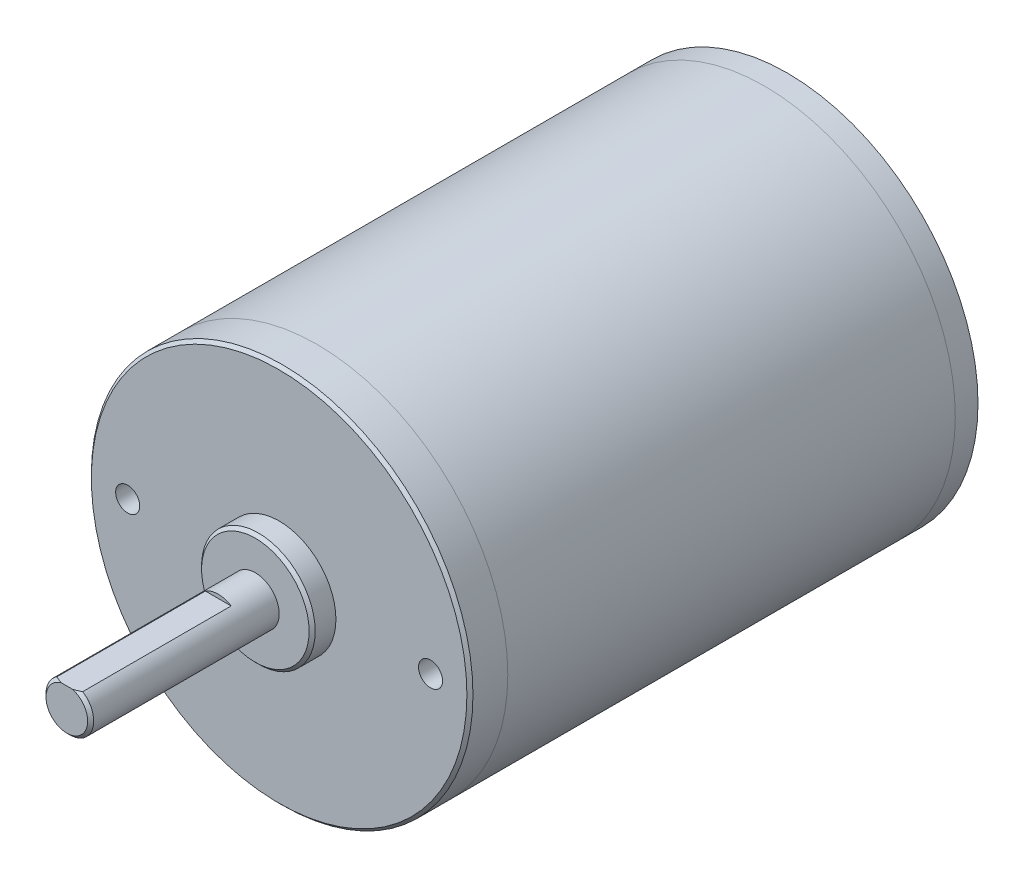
ISO-10303-21;
HEADER;
FILE_DESCRIPTION(('STEP AP214'),'2;1');
FILE_NAME('part.step','',(''),(''),'','','');
FILE_SCHEMA(('AUTOMOTIVE_DESIGN { 1 0 10303 214 1 1 1 1 }'));
ENDSEC;
DATA;
#1=APPLICATION_CONTEXT('core data for automotive mechanical design processes');
#2=APPLICATION_PROTOCOL_DEFINITION('international standard','automotive_design',2000,#1);
#3=PRODUCT_CONTEXT('',#1,'mechanical');
#4=PRODUCT('Part','Part','',(#3));
#5=PRODUCT_RELATED_PRODUCT_CATEGORY('part','',(#4));
#6=PRODUCT_DEFINITION_FORMATION('','',#4);
#7=PRODUCT_DEFINITION_CONTEXT('part definition',#1,'design');
#8=PRODUCT_DEFINITION('design','',#6,#7);
#9=PRODUCT_DEFINITION_SHAPE('','',#8);
#10=(LENGTH_UNIT() NAMED_UNIT(*) SI_UNIT(.MILLI.,.METRE.));
#11=(NAMED_UNIT(*) PLANE_ANGLE_UNIT() SI_UNIT($,.RADIAN.));
#12=(NAMED_UNIT(*) SI_UNIT($,.STERADIAN.) SOLID_ANGLE_UNIT());
#13=UNCERTAINTY_MEASURE_WITH_UNIT(LENGTH_MEASURE(1.E-05),#10,'distance_accuracy_value','');
#14=(GEOMETRIC_REPRESENTATION_CONTEXT(3) GLOBAL_UNCERTAINTY_ASSIGNED_CONTEXT((#13)) GLOBAL_UNIT_ASSIGNED_CONTEXT((#10,
#11,#12)) REPRESENTATION_CONTEXT('',''));
#15=CARTESIAN_POINT('',(0.,0.,0.));
#16=DIRECTION('',(0.,0.,1.));
#17=DIRECTION('',(1.,0.,0.));
#18=AXIS2_PLACEMENT_3D('',#15,#16,#17);
#19=CARTESIAN_POINT('',(0.,0.,120.8278));
#20=DIRECTION('',(0.,0.,-1.));
#21=DIRECTION('',(-1.,0.,0.));
#22=AXIS2_PLACEMENT_3D('',#19,#20,#21);
#23=CYLINDRICAL_SURFACE('',#22,4.0005);
#24=CARTESIAN_POINT('',(0.,0.,89.2048));
#25=DIRECTION('',(0.,0.,1.));
#26=DIRECTION('',(1.,0.,0.));
#27=AXIS2_PLACEMENT_3D('',#24,#25,#26);
#28=CIRCLE('',#27,4.0005);
#29=CARTESIAN_POINT('',(4.0005,0.,89.2048));
#30=VERTEX_POINT('',#29);
#31=EDGE_CURVE('E155',#30,#30,#28,.T.);
#32=ORIENTED_EDGE('',*,*,#31,.T.);
#33=EDGE_LOOP('',(#32));
#34=FACE_BOUND('',#33,.T.);
#35=DIRECTION('',(0.,0.,-1.));
#36=VECTOR('',#35,1.);
#37=CARTESIAN_POINT('',(2.16273206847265,3.3655,120.8278));
#38=LINE('',#37,#36);
#39=CARTESIAN_POINT('',(2.16273206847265,3.3655,120.3198));
#40=VERTEX_POINT('',#39);
#41=CARTESIAN_POINT('',(2.16273206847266,3.3655,95.4278));
#42=VERTEX_POINT('',#41);
#43=EDGE_CURVE('E139',#40,#42,#38,.T.);
#44=ORIENTED_EDGE('',*,*,#43,.F.);
#45=CARTESIAN_POINT('',(0.,0.,120.3198));
#46=DIRECTION('',(0.,0.,1.));
#47=DIRECTION('',(1.,0.,0.));
#48=AXIS2_PLACEMENT_3D('',#45,#46,#47);
#49=CIRCLE('',#48,4.0005);
#50=CARTESIAN_POINT('',(-2.16273206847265,3.3655,120.3198));
#51=VERTEX_POINT('',#50);
#52=EDGE_CURVE('E12',#40,#51,#49,.F.);
#53=ORIENTED_EDGE('',*,*,#52,.T.);
#54=DIRECTION('',(0.,0.,-1.));
#55=VECTOR('',#54,1.);
#56=CARTESIAN_POINT('',(-2.16273206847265,3.3655,120.8278));
#57=LINE('',#56,#55);
#58=CARTESIAN_POINT('',(-2.16273206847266,3.3655,95.4278));
#59=VERTEX_POINT('',#58);
#60=EDGE_CURVE('E145',#59,#51,#57,.F.);
#61=ORIENTED_EDGE('',*,*,#60,.F.);
#62=CARTESIAN_POINT('',(0.,0.,95.4278));
#63=DIRECTION('',(0.,0.,-1.));
#64=DIRECTION('',(-1.,0.,0.));
#65=AXIS2_PLACEMENT_3D('',#62,#63,#64);
#66=CIRCLE('',#65,4.0005);
#67=EDGE_CURVE('E151',#42,#59,#66,.F.);
#68=ORIENTED_EDGE('',*,*,#67,.F.);
#69=EDGE_LOOP('',(#44,#53,#61,#68));
#70=FACE_BOUND('',#69,.T.);
#71=CARTESIAN_POINT('',(-0.990599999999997,-3.87591432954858,92.329));
#72=CARTESIAN_POINT('',(-0.990600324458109,-3.87591250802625,92.301588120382));
#73=CARTESIAN_POINT('',(-0.989461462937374,-3.8762054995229,92.2741898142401));
#74=CARTESIAN_POINT('',(-0.984921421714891,-3.87736227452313,92.2195979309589));
#75=CARTESIAN_POINT('',(-0.981520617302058,-3.87822596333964,92.1924043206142));
#76=CARTESIAN_POINT('',(-0.967974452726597,-3.88163852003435,92.1115363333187));
#77=CARTESIAN_POINT('',(-0.954485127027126,-3.88500908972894,92.0584173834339));
#78=CARTESIAN_POINT('',(-0.919024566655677,-3.89354877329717,91.955288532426));
#79=CARTESIAN_POINT('',(-0.89705403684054,-3.89871773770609,91.905278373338));
#80=CARTESIAN_POINT('',(-0.845280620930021,-3.9102688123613,91.8096291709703));
#81=CARTESIAN_POINT('',(-0.815475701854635,-3.91665123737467,91.7639912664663));
#82=CARTESIAN_POINT('',(-0.748200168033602,-3.93006266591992,91.6774264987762));
#83=CARTESIAN_POINT('',(-0.710592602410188,-3.93710177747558,91.6366076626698));
#84=CARTESIAN_POINT('',(-0.629070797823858,-3.95094633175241,91.5617843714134));
#85=CARTESIAN_POINT('',(-0.585155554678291,-3.95775173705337,91.527781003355));
#86=CARTESIAN_POINT('',(-0.491523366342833,-3.97047403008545,91.4671145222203));
#87=CARTESIAN_POINT('',(-0.441735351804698,-3.97637750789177,91.4405580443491));
#88=CARTESIAN_POINT('',(-0.338233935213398,-3.98651448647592,91.396233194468));
#89=CARTESIAN_POINT('',(-0.284521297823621,-3.99074831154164,91.3784631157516));
#90=CARTESIAN_POINT('',(-0.175826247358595,-3.99699745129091,91.3525613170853));
#91=CARTESIAN_POINT('',(-0.120890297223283,-3.9990551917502,91.3442450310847));
#92=CARTESIAN_POINT('',(-0.0103658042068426,-4.00086811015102,91.3369076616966));
#93=CARTESIAN_POINT('',(0.0452226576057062,-4.00062357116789,91.3378854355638));
#94=CARTESIAN_POINT('',(0.154192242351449,-3.99789104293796,91.3489756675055));
#95=CARTESIAN_POINT('',(0.207595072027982,-3.99545202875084,91.3588887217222));
#96=CARTESIAN_POINT('',(0.311953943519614,-3.98866156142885,91.3872477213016));
#97=CARTESIAN_POINT('',(0.362909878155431,-3.98431002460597,91.4056940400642));
#98=CARTESIAN_POINT('',(0.461457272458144,-3.97410816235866,91.4507587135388));
#99=CARTESIAN_POINT('',(0.509014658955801,-3.96824481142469,91.4774485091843));
#100=CARTESIAN_POINT('',(0.599044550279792,-3.9556561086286,91.5381878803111));
#101=CARTESIAN_POINT('',(0.641516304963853,-3.94893062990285,91.5722385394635));
#102=CARTESIAN_POINT('',(0.721355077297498,-3.93514089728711,91.6477986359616));
#103=CARTESIAN_POINT('',(0.758557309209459,-3.9280723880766,91.6894815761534));
#104=CARTESIAN_POINT('',(0.825488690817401,-3.91455467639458,91.7785807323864));
#105=CARTESIAN_POINT('',(0.855215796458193,-3.9081056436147,91.8259985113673));
#106=CARTESIAN_POINT('',(0.906458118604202,-3.89654079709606,91.9255476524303));
#107=CARTESIAN_POINT('',(0.927929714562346,-3.89143210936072,91.9777022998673));
#108=CARTESIAN_POINT('',(0.961721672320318,-3.88322020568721,92.085006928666));
#109=CARTESIAN_POINT('',(0.974055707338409,-3.88011399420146,92.1401523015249));
#110=CARTESIAN_POINT('',(0.984612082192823,-3.87744060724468,92.2179777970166));
#111=CARTESIAN_POINT('',(0.986857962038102,-3.8768691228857,92.2401373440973));
#112=CARTESIAN_POINT('',(0.989850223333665,-3.87610616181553,92.2845277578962));
#113=CARTESIAN_POINT('',(0.990599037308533,-3.87591406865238,92.3067584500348));
#114=CARTESIAN_POINT('',(0.990599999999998,-3.87591432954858,92.329));
#115=B_SPLINE_CURVE_WITH_KNOTS('',3,(#71,#72,#73,#74,#75,#76,#77,#78,#79,#80,#81,#82,#83,#84,
#85,#86,#87,#88,#89,#90,#91,#92,#93,#94,#95,#96,#97,#98,#99,#100,#101,#102,#103,#104,#105,#106,
#107,#108,#109,#110,#111,#112,#113,#114),.UNSPECIFIED.,.F.,.F.,(4,2,2,2,2,2,2,2,2,2,2,2,2,2,2,2,
2,2,2,2,2,4),(0.,0.0821837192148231,0.164353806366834,0.328227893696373,0.492088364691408,
0.655991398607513,0.823060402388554,0.990156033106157,1.15953464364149,1.32888034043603,
1.49485985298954,1.66081895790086,1.82316371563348,1.98551557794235,2.14931591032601,
2.31314037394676,2.481299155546,2.64950386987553,2.81858551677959,2.98741364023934,
3.05421190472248,3.12090154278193),.UNSPECIFIED.);
#116=CARTESIAN_POINT('',(-0.990599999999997,-3.87591432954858,92.329));
#117=VERTEX_POINT('',#116);
#118=CARTESIAN_POINT('',(0.990599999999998,-3.87591432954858,92.329));
#119=VERTEX_POINT('',#118);
#120=EDGE_CURVE('E164',#117,#119,#115,.T.);
#121=ORIENTED_EDGE('',*,*,#120,.F.);
#122=DIRECTION('',(0.,0.,-1.));
#123=VECTOR('',#122,1.);
#124=CARTESIAN_POINT('',(-0.990600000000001,-3.87591432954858,120.8278));
#125=LINE('',#124,#123);
#126=CARTESIAN_POINT('',(-0.990599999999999,-3.87591432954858,111.8362));
#127=VERTEX_POINT('',#126);
#128=EDGE_CURVE('E122',#127,#117,#125,.T.);
#129=ORIENTED_EDGE('',*,*,#128,.F.);
#130=CARTESIAN_POINT('',(-0.990599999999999,-3.87591432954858,111.8362));
#131=CARTESIAN_POINT('',(-0.990600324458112,-3.87591250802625,111.863611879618));
#132=CARTESIAN_POINT('',(-0.989461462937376,-3.8762054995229,111.89101018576));
#133=CARTESIAN_POINT('',(-0.984921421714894,-3.87736227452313,111.945602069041));
#134=CARTESIAN_POINT('',(-0.981520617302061,-3.87822596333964,111.972795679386));
#135=CARTESIAN_POINT('',(-0.9679744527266,-3.88163852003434,112.053663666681));
#136=CARTESIAN_POINT('',(-0.954485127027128,-3.88500908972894,112.106782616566));
#137=CARTESIAN_POINT('',(-0.919024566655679,-3.89354877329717,112.209911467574));
#138=CARTESIAN_POINT('',(-0.897054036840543,-3.89871773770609,112.259921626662));
#139=CARTESIAN_POINT('',(-0.845280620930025,-3.9102688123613,112.35557082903));
#140=CARTESIAN_POINT('',(-0.815475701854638,-3.91665123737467,112.401208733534));
#141=CARTESIAN_POINT('',(-0.748200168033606,-3.93006266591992,112.487773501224));
#142=CARTESIAN_POINT('',(-0.710592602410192,-3.93710177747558,112.52859233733));
#143=CARTESIAN_POINT('',(-0.629070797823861,-3.95094633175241,112.603415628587));
#144=CARTESIAN_POINT('',(-0.585155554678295,-3.95775173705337,112.637418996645));
#145=CARTESIAN_POINT('',(-0.491523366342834,-3.97047403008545,112.69808547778));
#146=CARTESIAN_POINT('',(-0.441735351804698,-3.97637750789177,112.724641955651));
#147=CARTESIAN_POINT('',(-0.338233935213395,-3.98651448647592,112.768966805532));
#148=CARTESIAN_POINT('',(-0.284521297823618,-3.99074831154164,112.786736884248));
#149=CARTESIAN_POINT('',(-0.175826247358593,-3.99699745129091,112.812638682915));
#150=CARTESIAN_POINT('',(-0.12089029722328,-3.9990551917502,112.820954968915));
#151=CARTESIAN_POINT('',(-0.0103658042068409,-4.00086811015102,112.828292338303));
#152=CARTESIAN_POINT('',(0.0452226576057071,-4.00062357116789,112.827314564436));
#153=CARTESIAN_POINT('',(0.15419224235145,-3.99789104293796,112.816224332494));
#154=CARTESIAN_POINT('',(0.207595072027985,-3.99545202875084,112.806311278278));
#155=CARTESIAN_POINT('',(0.311953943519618,-3.98866156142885,112.777952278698));
#156=CARTESIAN_POINT('',(0.362909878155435,-3.98431002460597,112.759505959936));
#157=CARTESIAN_POINT('',(0.461457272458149,-3.97410816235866,112.714441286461));
#158=CARTESIAN_POINT('',(0.509014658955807,-3.96824481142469,112.687751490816));
#159=CARTESIAN_POINT('',(0.599044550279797,-3.9556561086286,112.627012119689));
#160=CARTESIAN_POINT('',(0.641516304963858,-3.94893062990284,112.592961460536));
#161=CARTESIAN_POINT('',(0.721355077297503,-3.93514089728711,112.517401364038));
#162=CARTESIAN_POINT('',(0.758557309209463,-3.9280723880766,112.475718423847));
#163=CARTESIAN_POINT('',(0.825488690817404,-3.91455467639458,112.386619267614));
#164=CARTESIAN_POINT('',(0.855215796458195,-3.9081056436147,112.339201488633));
#165=CARTESIAN_POINT('',(0.906458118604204,-3.89654079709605,112.23965234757));
#166=CARTESIAN_POINT('',(0.927929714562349,-3.89143210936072,112.187497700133));
#167=CARTESIAN_POINT('',(0.961721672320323,-3.88322020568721,112.080193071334));
#168=CARTESIAN_POINT('',(0.974055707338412,-3.88011399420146,112.025047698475));
#169=CARTESIAN_POINT('',(0.984612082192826,-3.87744060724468,111.947222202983));
#170=CARTESIAN_POINT('',(0.986857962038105,-3.8768691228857,111.925062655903));
#171=CARTESIAN_POINT('',(0.989850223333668,-3.87610616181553,111.880672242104));
#172=CARTESIAN_POINT('',(0.990599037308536,-3.87591406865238,111.858441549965));
#173=CARTESIAN_POINT('',(0.9906,-3.87591432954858,111.8362));
#174=B_SPLINE_CURVE_WITH_KNOTS('',3,(#130,#131,#132,#133,#134,#135,#136,#137,#138,#139,#140,
#141,#142,#143,#144,#145,#146,#147,#148,#149,#150,#151,#152,#153,#154,#155,#156,#157,#158,#159,
#160,#161,#162,#163,#164,#165,#166,#167,#168,#169,#170,#171,#172,#173),.UNSPECIFIED.,.F.,.F.,(4,
2,2,2,2,2,2,2,2,2,2,2,2,2,2,2,2,2,2,2,2,4),(0.,0.0821837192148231,0.164353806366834,
0.328227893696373,0.492088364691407,0.655991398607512,0.823060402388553,0.990156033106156,
1.1595346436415,1.32888034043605,1.49485985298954,1.66081895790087,1.82316371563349,
1.98551557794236,2.14931591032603,2.31314037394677,2.48129915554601,2.64950386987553,
2.81858551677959,2.98741364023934,3.05421190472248,3.12090154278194),.UNSPECIFIED.);
#175=CARTESIAN_POINT('',(0.9906,-3.87591432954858,111.8362));
#176=VERTEX_POINT('',#175);
#177=EDGE_CURVE('E260',#127,#176,#174,.T.);
#178=ORIENTED_EDGE('',*,*,#177,.T.);
#179=DIRECTION('',(0.,0.,-1.));
#180=VECTOR('',#179,1.);
#181=CARTESIAN_POINT('',(0.990600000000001,-3.87591432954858,120.8278));
#182=LINE('',#181,#180);
#183=EDGE_CURVE('E171',#176,#119,#182,.T.);
#184=ORIENTED_EDGE('',*,*,#183,.T.);
#185=EDGE_LOOP('',(#121,#129,#178,#184));
#186=FACE_BOUND('',#185,.T.);
#187=ADVANCED_FACE('F43',(#34,#70,#186),#23,.T.);
#188=CARTESIAN_POINT('',(0.,0.,85.217));
#189=DIRECTION('',(0.,0.,-1.));
#190=DIRECTION('',(-1.,0.,0.));
#191=AXIS2_PLACEMENT_3D('',#188,#189,#190);
#192=CYLINDRICAL_SURFACE('',#191,32.004);
#193=CARTESIAN_POINT('',(0.,0.,84.709));
#194=DIRECTION('',(0.,0.,1.));
#195=DIRECTION('',(1.,0.,0.));
#196=AXIS2_PLACEMENT_3D('',#193,#194,#195);
#197=CIRCLE('',#196,32.004);
#198=CARTESIAN_POINT('',(32.004,0.,84.709));
#199=VERTEX_POINT('',#198);
#200=EDGE_CURVE('E449',#199,#199,#197,.F.);
#201=ORIENTED_EDGE('',*,*,#200,.T.);
#202=EDGE_LOOP('',(#201));
#203=FACE_BOUND('',#202,.T.);
#204=CARTESIAN_POINT('',(0.,0.,78.867));
#205=DIRECTION('',(0.,0.,1.));
#206=DIRECTION('',(1.,0.,0.));
#207=AXIS2_PLACEMENT_3D('',#204,#205,#206);
#208=CIRCLE('',#207,32.004);
#209=CARTESIAN_POINT('',(32.004,0.,78.867));
#210=VERTEX_POINT('',#209);
#211=EDGE_CURVE('E161',#210,#210,#208,.T.);
#212=ORIENTED_EDGE('',*,*,#211,.T.);
#213=EDGE_LOOP('',(#212));
#214=FACE_BOUND('',#213,.T.);
#215=ADVANCED_FACE('F224',(#203,#214),#192,.T.);
#216=CARTESIAN_POINT('',(0.,0.,85.217));
#217=DIRECTION('',(0.,0.,1.));
#218=DIRECTION('',(1.,0.,0.));
#219=AXIS2_PLACEMENT_3D('',#216,#217,#218);
#220=PLANE('',#219);
#221=CARTESIAN_POINT('',(25.4,0.,85.217));
#222=DIRECTION('',(0.,0.,1.));
#223=DIRECTION('',(1.,0.,0.));
#224=AXIS2_PLACEMENT_3D('',#221,#222,#223);
#225=CIRCLE('',#224,2.0193);
#226=CARTESIAN_POINT('',(27.4193,0.,85.217));
#227=VERTEX_POINT('',#226);
#228=EDGE_CURVE('E204',#227,#227,#225,.T.);
#229=ORIENTED_EDGE('',*,*,#228,.F.);
#230=EDGE_LOOP('',(#229));
#231=FACE_BOUND('',#230,.T.);
#232=CARTESIAN_POINT('',(-25.4,0.,85.217));
#233=DIRECTION('',(0.,0.,1.));
#234=DIRECTION('',(1.,0.,0.));
#235=AXIS2_PLACEMENT_3D('',#232,#233,#234);
#236=CIRCLE('',#235,2.0193);
#237=CARTESIAN_POINT('',(-23.3807,0.,85.217));
#238=VERTEX_POINT('',#237);
#239=EDGE_CURVE('E209',#238,#238,#236,.T.);
#240=ORIENTED_EDGE('',*,*,#239,.F.);
#241=EDGE_LOOP('',(#240));
#242=FACE_BOUND('',#241,.T.);
#243=CARTESIAN_POINT('',(0.,0.,85.217));
#244=DIRECTION('',(0.,0.,1.));
#245=DIRECTION('',(1.,0.,0.));
#246=AXIS2_PLACEMENT_3D('',#243,#244,#245);
#247=CIRCLE('',#246,31.496);
#248=CARTESIAN_POINT('',(31.496,0.,85.217));
#249=VERTEX_POINT('',#248);
#250=EDGE_CURVE('E230',#249,#249,#247,.T.);
#251=ORIENTED_EDGE('',*,*,#250,.T.);
#252=EDGE_LOOP('',(#251));
#253=FACE_BOUND('',#252,.T.);
#254=CARTESIAN_POINT('',(0.,0.,85.217));
#255=DIRECTION('',(0.,0.,1.));
#256=DIRECTION('',(1.,0.,0.));
#257=AXIS2_PLACEMENT_3D('',#254,#255,#256);
#258=CIRCLE('',#257,9.525);
#259=CARTESIAN_POINT('',(9.525,0.,85.217));
#260=VERTEX_POINT('',#259);
#261=EDGE_CURVE('E158',#260,#260,#258,.T.);
#262=ORIENTED_EDGE('',*,*,#261,.F.);
#263=EDGE_LOOP('',(#262));
#264=FACE_BOUND('',#263,.T.);
#265=ADVANCED_FACE('F220',(#231,#242,#253,#264),#220,.T.);
#266=CARTESIAN_POINT('',(0.,0.,78.867));
#267=DIRECTION('',(0.,0.,1.));
#268=DIRECTION('',(1.,0.,0.));
#269=AXIS2_PLACEMENT_3D('',#266,#267,#268);
#270=PLANE('',#269);
#271=CARTESIAN_POINT('',(0.,0.,78.867));
#272=DIRECTION('',(0.,0.,1.));
#273=DIRECTION('',(1.,0.,0.));
#274=AXIS2_PLACEMENT_3D('',#271,#272,#273);
#275=CIRCLE('',#274,30.4673);
#276=CARTESIAN_POINT('',(30.4673,0.,78.867));
#277=VERTEX_POINT('',#276);
#278=EDGE_CURVE('E131',#277,#277,#275,.T.);
#279=ORIENTED_EDGE('',*,*,#278,.T.);
#280=EDGE_LOOP('',(#279));
#281=FACE_BOUND('',#280,.T.);
#282=ORIENTED_EDGE('',*,*,#211,.F.);
#283=EDGE_LOOP('',(#282));
#284=FACE_BOUND('',#283,.T.);
#285=ADVANCED_FACE('F223',(#281,#284),#270,.F.);
#286=CARTESIAN_POINT('',(0.,0.,89.2048));
#287=DIRECTION('',(0.,0.,-1.));
#288=DIRECTION('',(-1.,0.,0.));
#289=AXIS2_PLACEMENT_3D('',#286,#287,#288);
#290=CYLINDRICAL_SURFACE('',#289,9.525);
#291=CARTESIAN_POINT('',(0.,0.,88.6968));
#292=DIRECTION('',(0.,0.,1.));
#293=DIRECTION('',(1.,0.,0.));
#294=AXIS2_PLACEMENT_3D('',#291,#292,#293);
#295=CIRCLE('',#294,9.525);
#296=CARTESIAN_POINT('',(9.525,0.,88.6968));
#297=VERTEX_POINT('',#296);
#298=EDGE_CURVE('E443',#297,#297,#295,.F.);
#299=ORIENTED_EDGE('',*,*,#298,.T.);
#300=EDGE_LOOP('',(#299));
#301=FACE_BOUND('',#300,.T.);
#302=ORIENTED_EDGE('',*,*,#261,.T.);
#303=EDGE_LOOP('',(#302));
#304=FACE_BOUND('',#303,.T.);
#305=ADVANCED_FACE('F233',(#301,#304),#290,.T.);
#306=CARTESIAN_POINT('',(0.,0.,89.2048));
#307=DIRECTION('',(0.,0.,1.));
#308=DIRECTION('',(1.,0.,0.));
#309=AXIS2_PLACEMENT_3D('',#306,#307,#308);
#310=PLANE('',#309);
#311=CARTESIAN_POINT('',(0.,0.,89.2048));
#312=DIRECTION('',(0.,0.,1.));
#313=DIRECTION('',(1.,0.,0.));
#314=AXIS2_PLACEMENT_3D('',#311,#312,#313);
#315=CIRCLE('',#314,9.01700000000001);
#316=CARTESIAN_POINT('',(9.01700000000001,0.,89.2048));
#317=VERTEX_POINT('',#316);
#318=EDGE_CURVE('E444',#317,#317,#315,.T.);
#319=ORIENTED_EDGE('',*,*,#318,.T.);
#320=EDGE_LOOP('',(#319));
#321=FACE_BOUND('',#320,.T.);
#322=ORIENTED_EDGE('',*,*,#31,.F.);
#323=EDGE_LOOP('',(#322));
#324=FACE_BOUND('',#323,.T.);
#325=ADVANCED_FACE('F235',(#321,#324),#310,.T.);
#326=CARTESIAN_POINT('',(0.,0.,120.8278));
#327=DIRECTION('',(0.,0.,1.));
#328=DIRECTION('',(1.,0.,0.));
#329=AXIS2_PLACEMENT_3D('',#326,#327,#328);
#330=PLANE('',#329);
#331=DIRECTION('',(-1.,0.,0.));
#332=VECTOR('',#331,1.);
#333=CARTESIAN_POINT('',(32.005,3.3655,120.8278));
#334=LINE('',#333,#332);
#335=CARTESIAN_POINT('',(0.933255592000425,3.3655,120.8278));
#336=VERTEX_POINT('',#335);
#337=CARTESIAN_POINT('',(-0.933255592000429,3.3655,120.8278));
#338=VERTEX_POINT('',#337);
#339=EDGE_CURVE('E148',#336,#338,#334,.T.);
#340=ORIENTED_EDGE('',*,*,#339,.T.);
#341=CARTESIAN_POINT('',(0.,0.,120.8278));
#342=DIRECTION('',(0.,0.,1.));
#343=DIRECTION('',(1.,0.,0.));
#344=AXIS2_PLACEMENT_3D('',#341,#342,#343);
#345=CIRCLE('',#344,3.49250000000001);
#346=EDGE_CURVE('E441',#338,#336,#345,.T.);
#347=ORIENTED_EDGE('',*,*,#346,.T.);
#348=EDGE_LOOP('',(#340,#347));
#349=FACE_BOUND('',#348,.T.);
#350=ADVANCED_FACE('F190',(#349),#330,.T.);
#351=CARTESIAN_POINT('',(32.005,3.3655,120.8278));
#352=DIRECTION('',(0.,-1.,0.));
#353=DIRECTION('',(0.,0.,-1.));
#354=AXIS2_PLACEMENT_3D('',#351,#352,#353);
#355=PLANE('',#354);
#356=ORIENTED_EDGE('',*,*,#339,.F.);
#357=CARTESIAN_POINT('',(0.933255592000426,3.3655,120.8278));
#358=CARTESIAN_POINT('',(1.04087980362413,3.3655,120.799037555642));
#359=CARTESIAN_POINT('',(1.14726164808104,3.3655,120.765993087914));
#360=CARTESIAN_POINT('',(1.35715872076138,3.3655,120.692790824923));
#361=CARTESIAN_POINT('',(1.4606824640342,3.3655,120.652657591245));
#362=CARTESIAN_POINT('',(1.66513568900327,3.3655,120.566547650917));
#363=CARTESIAN_POINT('',(1.76606708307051,3.3655,120.520575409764));
#364=CARTESIAN_POINT('',(1.96594131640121,3.3655,120.423645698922));
#365=CARTESIAN_POINT('',(2.06487621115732,3.3655,120.37267178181));
#366=CARTESIAN_POINT('',(2.16273206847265,3.3655,120.3198));
#367=B_SPLINE_CURVE_WITH_KNOTS('',3,(#357,#358,#359,#360,#361,#362,#363,#364,#365,#366),
.UNSPECIFIED.,.F.,.F.,(4,2,2,2,4),(0.,0.333979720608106,0.666824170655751,0.999415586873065,
1.33313988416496),.UNSPECIFIED.);
#368=EDGE_CURVE('E53',#336,#40,#367,.T.);
#369=ORIENTED_EDGE('',*,*,#368,.T.);
#370=ORIENTED_EDGE('',*,*,#43,.T.);
#371=DIRECTION('',(-1.,0.,0.));
#372=VECTOR('',#371,1.);
#373=CARTESIAN_POINT('',(32.005,3.3655,95.4278));
#374=LINE('',#373,#372);
#375=EDGE_CURVE('E147',#42,#59,#374,.T.);
#376=ORIENTED_EDGE('',*,*,#375,.T.);
#377=ORIENTED_EDGE('',*,*,#60,.T.);
#378=CARTESIAN_POINT('',(-2.16273206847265,3.3655,120.3198));
#379=CARTESIAN_POINT('',(-2.06487621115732,3.3655,120.37267178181));
#380=CARTESIAN_POINT('',(-1.96594131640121,3.3655,120.423645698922));
#381=CARTESIAN_POINT('',(-1.76606708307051,3.3655,120.520575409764));
#382=CARTESIAN_POINT('',(-1.66513568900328,3.3655,120.566547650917));
#383=CARTESIAN_POINT('',(-1.4606824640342,3.3655,120.652657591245));
#384=CARTESIAN_POINT('',(-1.35715872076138,3.3655,120.692790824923));
#385=CARTESIAN_POINT('',(-1.14726164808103,3.3655,120.765993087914));
#386=CARTESIAN_POINT('',(-1.04087980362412,3.3655,120.799037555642));
#387=CARTESIAN_POINT('',(-0.933255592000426,3.3655,120.8278));
#388=B_SPLINE_CURVE_WITH_KNOTS('',3,(#378,#379,#380,#381,#382,#383,#384,#385,#386,#387),
.UNSPECIFIED.,.F.,.F.,(4,2,2,2,4),(0.,0.333724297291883,0.666315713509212,0.999160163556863,
1.33313988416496),.UNSPECIFIED.);
#389=EDGE_CURVE('E193',#51,#338,#388,.T.);
#390=ORIENTED_EDGE('',*,*,#389,.T.);
#391=EDGE_LOOP('',(#356,#369,#370,#376,#377,#390));
#392=FACE_BOUND('',#391,.T.);
#393=ADVANCED_FACE('F186',(#392),#355,.F.);
#394=CARTESIAN_POINT('',(32.005,3.3655,95.4278));
#395=DIRECTION('',(0.,0.,-1.));
#396=DIRECTION('',(-1.,0.,0.));
#397=AXIS2_PLACEMENT_3D('',#394,#395,#396);
#398=PLANE('',#397);
#399=ORIENTED_EDGE('',*,*,#67,.T.);
#400=ORIENTED_EDGE('',*,*,#375,.F.);
#401=EDGE_LOOP('',(#399,#400));
#402=FACE_BOUND('',#401,.T.);
#403=ADVANCED_FACE('F185',(#402),#398,.F.);
#404=CARTESIAN_POINT('',(-0.990599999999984,-2.8067,0.));
#405=DIRECTION('',(1.,0.,0.));
#406=DIRECTION('',(0.,0.,-1.));
#407=AXIS2_PLACEMENT_3D('',#404,#405,#406);
#408=PLANE('',#407);
#409=ORIENTED_EDGE('',*,*,#128,.T.);
#410=DIRECTION('',(0.,-1.,0.));
#411=VECTOR('',#410,1.);
#412=CARTESIAN_POINT('',(-0.990599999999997,-2.8067,92.329));
#413=LINE('',#412,#411);
#414=CARTESIAN_POINT('',(-0.990599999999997,-2.8067,92.329));
#415=VERTEX_POINT('',#414);
#416=EDGE_CURVE('E106',#415,#117,#413,.T.);
#417=ORIENTED_EDGE('',*,*,#416,.F.);
#418=DIRECTION('',(0.,0.,1.));
#419=VECTOR('',#418,1.);
#420=CARTESIAN_POINT('',(-0.990599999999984,-2.8067,0.));
#421=LINE('',#420,#419);
#422=CARTESIAN_POINT('',(-0.990599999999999,-2.8067,111.8362));
#423=VERTEX_POINT('',#422);
#424=EDGE_CURVE('E114',#415,#423,#421,.T.);
#425=ORIENTED_EDGE('',*,*,#424,.T.);
#426=DIRECTION('',(0.,-1.,0.));
#427=VECTOR('',#426,1.);
#428=CARTESIAN_POINT('',(-0.990599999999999,-2.8067,111.8362));
#429=LINE('',#428,#427);
#430=EDGE_CURVE('E137',#423,#127,#429,.T.);
#431=ORIENTED_EDGE('',*,*,#430,.T.);
#432=EDGE_LOOP('',(#409,#417,#425,#431));
#433=FACE_BOUND('',#432,.T.);
#434=ADVANCED_FACE('F118',(#433),#408,.T.);
#435=CARTESIAN_POINT('',(0.,-2.8067,111.8362));
#436=DIRECTION('',(0.,-1.,0.));
#437=DIRECTION('',(0.,0.,-1.));
#438=AXIS2_PLACEMENT_3D('',#435,#436,#437);
#439=CYLINDRICAL_SURFACE('',#438,0.9906);
#440=ORIENTED_EDGE('',*,*,#430,.F.);
#441=CARTESIAN_POINT('',(0.,-2.8067,111.8362));
#442=DIRECTION('',(0.,-1.,0.));
#443=DIRECTION('',(0.,0.,-1.));
#444=AXIS2_PLACEMENT_3D('',#441,#442,#443);
#445=CIRCLE('',#444,0.9906);
#446=CARTESIAN_POINT('',(0.9906,-2.8067,111.8362));
#447=VERTEX_POINT('',#446);
#448=EDGE_CURVE('E123',#447,#423,#445,.T.);
#449=ORIENTED_EDGE('',*,*,#448,.F.);
#450=DIRECTION('',(0.,-1.,0.));
#451=VECTOR('',#450,1.);
#452=CARTESIAN_POINT('',(0.9906,-2.8067,111.8362));
#453=LINE('',#452,#451);
#454=EDGE_CURVE('E140',#447,#176,#453,.T.);
#455=ORIENTED_EDGE('',*,*,#454,.T.);
#456=ORIENTED_EDGE('',*,*,#177,.F.);
#457=EDGE_LOOP('',(#440,#449,#455,#456));
#458=FACE_BOUND('',#457,.T.);
#459=ADVANCED_FACE('F184',(#458),#439,.F.);
#460=CARTESIAN_POINT('',(0.990599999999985,-2.8067,0.));
#461=DIRECTION('',(1.,0.,0.));
#462=DIRECTION('',(0.,0.,-1.));
#463=AXIS2_PLACEMENT_3D('',#460,#461,#462);
#464=PLANE('',#463);
#465=ORIENTED_EDGE('',*,*,#454,.F.);
#466=DIRECTION('',(0.,0.,1.));
#467=VECTOR('',#466,1.);
#468=CARTESIAN_POINT('',(0.990599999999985,-2.8067,0.));
#469=LINE('',#468,#467);
#470=CARTESIAN_POINT('',(0.990599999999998,-2.8067,92.329));
#471=VERTEX_POINT('',#470);
#472=EDGE_CURVE('E113',#471,#447,#469,.T.);
#473=ORIENTED_EDGE('',*,*,#472,.F.);
#474=DIRECTION('',(0.,-1.,0.));
#475=VECTOR('',#474,1.);
#476=CARTESIAN_POINT('',(0.990599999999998,-2.8067,92.329));
#477=LINE('',#476,#475);
#478=EDGE_CURVE('E108',#471,#119,#477,.T.);
#479=ORIENTED_EDGE('',*,*,#478,.T.);
#480=ORIENTED_EDGE('',*,*,#183,.F.);
#481=EDGE_LOOP('',(#465,#473,#479,#480));
#482=FACE_BOUND('',#481,.T.);
#483=ADVANCED_FACE('F180',(#482),#464,.F.);
#484=CARTESIAN_POINT('',(0.,-2.8067,92.329));
#485=DIRECTION('',(0.,-1.,0.));
#486=DIRECTION('',(0.,0.,-1.));
#487=AXIS2_PLACEMENT_3D('',#484,#485,#486);
#488=CYLINDRICAL_SURFACE('',#487,0.990599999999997);
#489=ORIENTED_EDGE('',*,*,#416,.T.);
#490=ORIENTED_EDGE('',*,*,#120,.T.);
#491=ORIENTED_EDGE('',*,*,#478,.F.);
#492=CARTESIAN_POINT('',(0.,-2.8067,92.329));
#493=DIRECTION('',(0.,-1.,0.));
#494=DIRECTION('',(0.,0.,-1.));
#495=AXIS2_PLACEMENT_3D('',#492,#493,#494);
#496=CIRCLE('',#495,0.990599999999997);
#497=EDGE_CURVE('E103',#471,#415,#496,.F.);
#498=ORIENTED_EDGE('',*,*,#497,.T.);
#499=EDGE_LOOP('',(#489,#490,#491,#498));
#500=FACE_BOUND('',#499,.T.);
#501=ADVANCED_FACE('F105',(#500),#488,.F.);
#502=CARTESIAN_POINT('',(0.,-2.8067,0.));
#503=DIRECTION('',(0.,-1.,0.));
#504=DIRECTION('',(0.,0.,-1.));
#505=AXIS2_PLACEMENT_3D('',#502,#503,#504);
#506=PLANE('',#505);
#507=ORIENTED_EDGE('',*,*,#424,.F.);
#508=ORIENTED_EDGE('',*,*,#497,.F.);
#509=ORIENTED_EDGE('',*,*,#472,.T.);
#510=ORIENTED_EDGE('',*,*,#448,.T.);
#511=EDGE_LOOP('',(#507,#508,#509,#510));
#512=FACE_BOUND('',#511,.T.);
#513=ADVANCED_FACE('F126',(#512),#506,.T.);
#514=CARTESIAN_POINT('',(0.,0.,85.217));
#515=DIRECTION('',(0.,0.,-1.));
#516=DIRECTION('',(-1.,0.,0.));
#517=AXIS2_PLACEMENT_3D('',#514,#515,#516);
#518=CONICAL_SURFACE('',#517,31.496,0.785398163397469);
#519=ORIENTED_EDGE('',*,*,#200,.F.);
#520=EDGE_LOOP('',(#519));
#521=FACE_BOUND('',#520,.T.);
#522=ORIENTED_EDGE('',*,*,#250,.F.);
#523=EDGE_LOOP('',(#522));
#524=FACE_BOUND('',#523,.T.);
#525=ADVANCED_FACE('F271',(#521,#524),#518,.T.);
#526=CARTESIAN_POINT('',(0.,0.,89.2048));
#527=DIRECTION('',(0.,0.,-1.));
#528=DIRECTION('',(-1.,0.,0.));
#529=AXIS2_PLACEMENT_3D('',#526,#527,#528);
#530=CONICAL_SURFACE('',#529,9.01700000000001,0.78539816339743);
#531=ORIENTED_EDGE('',*,*,#298,.F.);
#532=EDGE_LOOP('',(#531));
#533=FACE_BOUND('',#532,.T.);
#534=ORIENTED_EDGE('',*,*,#318,.F.);
#535=EDGE_LOOP('',(#534));
#536=FACE_BOUND('',#535,.T.);
#537=ADVANCED_FACE('F316',(#533,#536),#530,.T.);
#538=CARTESIAN_POINT('',(0.,0.,120.8278));
#539=DIRECTION('',(0.,0.,-1.));
#540=DIRECTION('',(-1.,0.,0.));
#541=AXIS2_PLACEMENT_3D('',#538,#539,#540);
#542=CONICAL_SURFACE('',#541,3.49250000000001,0.78539816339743);
#543=ORIENTED_EDGE('',*,*,#389,.F.);
#544=ORIENTED_EDGE('',*,*,#52,.F.);
#545=ORIENTED_EDGE('',*,*,#368,.F.);
#546=ORIENTED_EDGE('',*,*,#346,.F.);
#547=EDGE_LOOP('',(#543,#544,#545,#546));
#548=FACE_BOUND('',#547,.T.);
#549=ADVANCED_FACE('F45',(#548),#542,.T.);
#550=CARTESIAN_POINT('',(0.,0.,75.565));
#551=DIRECTION('',(0.,0.,1.));
#552=DIRECTION('',(1.,0.,0.));
#553=AXIS2_PLACEMENT_3D('',#550,#551,#552);
#554=CYLINDRICAL_SURFACE('',#553,30.4673);
#555=CARTESIAN_POINT('',(0.,0.,75.565));
#556=DIRECTION('',(0.,0.,1.));
#557=DIRECTION('',(1.,0.,0.));
#558=AXIS2_PLACEMENT_3D('',#555,#556,#557);
#559=CIRCLE('',#558,30.4673);
#560=CARTESIAN_POINT('',(30.4673,0.,75.565));
#561=VERTEX_POINT('',#560);
#562=EDGE_CURVE('E128',#561,#561,#559,.T.);
#563=CARTESIAN_POINT('',(30.4673,0.,75.565));
#564=CARTESIAN_POINT('',(30.4673,0.,75.5993958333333));
#565=CARTESIAN_POINT('',(30.4673,0.,75.6337916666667));
#566=CARTESIAN_POINT('',(30.4673,0.,75.7025833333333));
#567=CARTESIAN_POINT('',(30.4673,0.,75.7369791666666));
#568=CARTESIAN_POINT('',(30.4673,0.,75.8057708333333));
#569=CARTESIAN_POINT('',(30.4673,0.,75.8401666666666));
#570=CARTESIAN_POINT('',(30.4673,0.,75.9089583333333));
#571=CARTESIAN_POINT('',(30.4673,0.,75.9433541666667));
#572=CARTESIAN_POINT('',(30.4673,0.,76.0121458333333));
#573=CARTESIAN_POINT('',(30.4673,0.,76.0465416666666));
#574=CARTESIAN_POINT('',(30.4673,0.,76.1153333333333));
#575=CARTESIAN_POINT('',(30.4673,0.,76.1497291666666));
#576=CARTESIAN_POINT('',(30.4673,0.,76.2185208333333));
#577=CARTESIAN_POINT('',(30.4673,0.,76.2529166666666));
#578=CARTESIAN_POINT('',(30.4673,0.,76.3217083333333));
#579=CARTESIAN_POINT('',(30.4673,0.,76.3561041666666));
#580=CARTESIAN_POINT('',(30.4673,0.,76.4248958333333));
#581=CARTESIAN_POINT('',(30.4673,0.,76.4592916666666));
#582=CARTESIAN_POINT('',(30.4673,0.,76.5280833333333));
#583=CARTESIAN_POINT('',(30.4673,0.,76.5624791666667));
#584=CARTESIAN_POINT('',(30.4673,0.,76.6312708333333));
#585=CARTESIAN_POINT('',(30.4673,0.,76.6656666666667));
#586=CARTESIAN_POINT('',(30.4673,0.,76.7344583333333));
#587=CARTESIAN_POINT('',(30.4673,0.,76.7688541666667));
#588=CARTESIAN_POINT('',(30.4673,0.,76.8376458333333));
#589=CARTESIAN_POINT('',(30.4673,0.,76.8720416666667));
#590=CARTESIAN_POINT('',(30.4673,0.,76.9408333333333));
#591=CARTESIAN_POINT('',(30.4673,0.,76.9752291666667));
#592=CARTESIAN_POINT('',(30.4673,0.,77.0440208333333));
#593=CARTESIAN_POINT('',(30.4673,0.,77.0784166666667));
#594=CARTESIAN_POINT('',(30.4673,0.,77.1472083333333));
#595=CARTESIAN_POINT('',(30.4673,0.,77.1816041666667));
#596=CARTESIAN_POINT('',(30.4673,0.,77.2503958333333));
#597=CARTESIAN_POINT('',(30.4673,0.,77.2847916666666));
#598=CARTESIAN_POINT('',(30.4673,0.,77.3535833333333));
#599=CARTESIAN_POINT('',(30.4673,0.,77.3879791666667));
#600=CARTESIAN_POINT('',(30.4673,0.,77.4567708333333));
#601=CARTESIAN_POINT('',(30.4673,0.,77.4911666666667));
#602=CARTESIAN_POINT('',(30.4673,0.,77.5599583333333));
#603=CARTESIAN_POINT('',(30.4673,0.,77.5943541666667));
#604=CARTESIAN_POINT('',(30.4673,0.,77.6631458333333));
#605=CARTESIAN_POINT('',(30.4673,0.,77.6975416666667));
#606=CARTESIAN_POINT('',(30.4673,0.,77.7663333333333));
#607=CARTESIAN_POINT('',(30.4673,0.,77.8007291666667));
#608=CARTESIAN_POINT('',(30.4673,0.,77.8695208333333));
#609=CARTESIAN_POINT('',(30.4673,0.,77.9039166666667));
#610=CARTESIAN_POINT('',(30.4673,0.,77.9727083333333));
#611=CARTESIAN_POINT('',(30.4673,0.,78.0071041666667));
#612=CARTESIAN_POINT('',(30.4673,0.,78.0758958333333));
#613=CARTESIAN_POINT('',(30.4673,0.,78.1102916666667));
#614=CARTESIAN_POINT('',(30.4673,0.,78.1790833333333));
#615=CARTESIAN_POINT('',(30.4673,0.,78.2134791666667));
#616=CARTESIAN_POINT('',(30.4673,0.,78.2822708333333));
#617=CARTESIAN_POINT('',(30.4673,0.,78.3166666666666));
#618=CARTESIAN_POINT('',(30.4673,0.,78.3854583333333));
#619=CARTESIAN_POINT('',(30.4673,0.,78.4198541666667));
#620=CARTESIAN_POINT('',(30.4673,0.,78.4886458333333));
#621=CARTESIAN_POINT('',(30.4673,0.,78.5230416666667));
#622=CARTESIAN_POINT('',(30.4673,0.,78.5918333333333));
#623=CARTESIAN_POINT('',(30.4673,0.,78.6262291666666));
#624=CARTESIAN_POINT('',(30.4673,0.,78.6950208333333));
#625=CARTESIAN_POINT('',(30.4673,0.,78.7294166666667));
#626=CARTESIAN_POINT('',(30.4673,0.,78.7982083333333));
#627=CARTESIAN_POINT('',(30.4673,0.,78.8326041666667));
#628=CARTESIAN_POINT('',(30.4673,0.,78.867));
#629=B_SPLINE_CURVE_WITH_KNOTS('',3,(#563,#564,#565,#566,#567,#568,#569,#570,#571,#572,#573,
#574,#575,#576,#577,#578,#579,#580,#581,#582,#583,#584,#585,#586,#587,#588,#589,#590,#591,#592,
#593,#594,#595,#596,#597,#598,#599,#600,#601,#602,#603,#604,#605,#606,#607,#608,#609,#610,#611,
#612,#613,#614,#615,#616,#617,#618,#619,#620,#621,#622,#623,#624,#625,#626,#627,#628),
.UNSPECIFIED.,.F.,.F.,(4,2,2,2,2,2,2,2,2,2,2,2,2,2,2,2,2,2,2,2,2,2,2,2,2,2,2,2,2,2,2,2,4),(0.,
0.10318749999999,0.206374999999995,0.309562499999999,0.41274999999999,0.515937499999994,
0.619124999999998,0.722312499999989,0.825499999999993,0.928687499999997,1.03187499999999,
1.13506249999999,1.23825,1.34143749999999,1.44462499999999,1.5478125,1.65099999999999,
1.75418749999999,1.85737499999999,1.9605625,2.06374999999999,2.16693749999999,2.270125,
2.37331249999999,2.47649999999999,2.5796875,2.68287499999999,2.78606249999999,2.88925,
2.99243749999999,3.09562499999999,3.19881249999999,3.30199999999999),.UNSPECIFIED.);
#630=EDGE_CURVE('BSEAM272',#561,#277,#629,.T.);
#631=ORIENTED_EDGE('',*,*,#562,.T.);
#632=ORIENTED_EDGE('',*,*,#278,.F.);
#633=ORIENTED_EDGE('',*,*,#630,.T.);
#634=ORIENTED_EDGE('',*,*,#630,.F.);
#635=EDGE_LOOP('',(#631,#633,#632,#634));
#636=FACE_BOUND('',#635,.T.);
#637=ADVANCED_FACE('F272',(#636),#554,.T.);
#638=CARTESIAN_POINT('',(0.,0.,75.565));
#639=DIRECTION('',(0.,0.,1.));
#640=DIRECTION('',(1.,0.,0.));
#641=AXIS2_PLACEMENT_3D('',#638,#639,#640);
#642=PLANE('',#641);
#643=CARTESIAN_POINT('',(25.4,0.,75.565));
#644=DIRECTION('',(0.,0.,1.));
#645=DIRECTION('',(1.,0.,0.));
#646=AXIS2_PLACEMENT_3D('',#643,#644,#645);
#647=CIRCLE('',#646,2.0193);
#648=CARTESIAN_POINT('',(27.4193,0.,75.565));
#649=VERTEX_POINT('',#648);
#650=EDGE_CURVE('E48',#649,#649,#647,.T.);
#651=ORIENTED_EDGE('',*,*,#650,.T.);
#652=EDGE_LOOP('',(#651));
#653=FACE_BOUND('',#652,.T.);
#654=CARTESIAN_POINT('',(-25.4,0.,75.565));
#655=DIRECTION('',(0.,0.,1.));
#656=DIRECTION('',(1.,0.,0.));
#657=AXIS2_PLACEMENT_3D('',#654,#655,#656);
#658=CIRCLE('',#657,2.0193);
#659=CARTESIAN_POINT('',(-23.3807,0.,75.565));
#660=VERTEX_POINT('',#659);
#661=EDGE_CURVE('E202',#660,#660,#658,.T.);
#662=ORIENTED_EDGE('',*,*,#661,.T.);
#663=EDGE_LOOP('',(#662));
#664=FACE_BOUND('',#663,.T.);
#665=ORIENTED_EDGE('',*,*,#562,.F.);
#666=EDGE_LOOP('',(#665));
#667=FACE_BOUND('',#666,.T.);
#668=ADVANCED_FACE('F275',(#653,#664,#667),#642,.F.);
#669=CARTESIAN_POINT('',(-25.4,0.,71.6026));
#670=DIRECTION('',(0.,0.,1.));
#671=DIRECTION('',(1.,0.,0.));
#672=AXIS2_PLACEMENT_3D('',#669,#670,#671);
#673=CYLINDRICAL_SURFACE('',#672,2.0193);
#674=ORIENTED_EDGE('',*,*,#239,.T.);
#675=EDGE_LOOP('',(#674));
#676=FACE_BOUND('',#675,.T.);
#677=ORIENTED_EDGE('',*,*,#661,.F.);
#678=EDGE_LOOP('',(#677));
#679=FACE_BOUND('',#678,.T.);
#680=ADVANCED_FACE('F217',(#676,#679),#673,.F.);
#681=CARTESIAN_POINT('',(25.4,0.,71.6026));
#682=DIRECTION('',(0.,0.,1.));
#683=DIRECTION('',(1.,0.,0.));
#684=AXIS2_PLACEMENT_3D('',#681,#682,#683);
#685=CYLINDRICAL_SURFACE('',#684,2.0193);
#686=ORIENTED_EDGE('',*,*,#228,.T.);
#687=EDGE_LOOP('',(#686));
#688=FACE_BOUND('',#687,.T.);
#689=ORIENTED_EDGE('',*,*,#650,.F.);
#690=EDGE_LOOP('',(#689));
#691=FACE_BOUND('',#690,.T.);
#692=ADVANCED_FACE('F282',(#688,#691),#685,.F.);
#693=CLOSED_SHELL('',(#187,#215,#265,#285,#305,#325,#350,#393,#403,#434,#459,#483,#501,#513,
#525,#537,#549,#637,#668,#680,#692));
#694=MANIFOLD_SOLID_BREP('B2',#693);
#695=CARTESIAN_POINT('',(0.,0.,78.867));
#696=DIRECTION('',(0.,0.,-1.));
#697=DIRECTION('',(-1.,0.,0.));
#698=AXIS2_PLACEMENT_3D('',#695,#696,#697);
#699=CYLINDRICAL_SURFACE('',#698,32.004);
#700=CARTESIAN_POINT('',(0.,0.,78.867));
#701=DIRECTION('',(0.,0.,1.));
#702=DIRECTION('',(1.,0.,0.));
#703=AXIS2_PLACEMENT_3D('',#700,#701,#702);
#704=CIRCLE('',#703,32.004);
#705=CARTESIAN_POINT('',(32.004,0.,78.867));
#706=VERTEX_POINT('',#705);
#707=EDGE_CURVE('E42',#706,#706,#704,.T.);
#708=ORIENTED_EDGE('',*,*,#707,.F.);
#709=EDGE_LOOP('',(#708));
#710=FACE_BOUND('',#709,.T.);
#711=CARTESIAN_POINT('',(0.,0.,3.81));
#712=DIRECTION('',(0.,0.,1.));
#713=DIRECTION('',(1.,0.,0.));
#714=AXIS2_PLACEMENT_3D('',#711,#712,#713);
#715=CIRCLE('',#714,32.004);
#716=CARTESIAN_POINT('',(32.004,0.,3.81));
#717=VERTEX_POINT('',#716);
#718=EDGE_CURVE('E478',#717,#717,#715,.T.);
#719=ORIENTED_EDGE('',*,*,#718,.T.);
#720=EDGE_LOOP('',(#719));
#721=FACE_BOUND('',#720,.T.);
#722=ADVANCED_FACE('F471',(#710,#721),#699,.T.);
#723=CARTESIAN_POINT('',(0.,0.,78.867));
#724=DIRECTION('',(0.,0.,1.));
#725=DIRECTION('',(1.,0.,0.));
#726=AXIS2_PLACEMENT_3D('',#723,#724,#725);
#727=PLANE('',#726);
#728=CARTESIAN_POINT('',(0.,0.,78.867));
#729=DIRECTION('',(0.,0.,-1.));
#730=DIRECTION('',(-1.,0.,0.));
#731=AXIS2_PLACEMENT_3D('',#728,#729,#730);
#732=CIRCLE('',#731,30.48);
#733=CARTESIAN_POINT('',(30.48,0.,78.867));
#734=VERTEX_POINT('',#733);
#735=EDGE_CURVE('E486',#734,#734,#732,.T.);
#736=ORIENTED_EDGE('',*,*,#735,.T.);
#737=EDGE_LOOP('',(#736));
#738=FACE_BOUND('',#737,.T.);
#739=ORIENTED_EDGE('',*,*,#707,.T.);
#740=EDGE_LOOP('',(#739));
#741=FACE_BOUND('',#740,.T.);
#742=ADVANCED_FACE('F507',(#738,#741),#727,.T.);
#743=CARTESIAN_POINT('',(0.,0.,3.81));
#744=DIRECTION('',(0.,0.,1.));
#745=DIRECTION('',(1.,0.,0.));
#746=AXIS2_PLACEMENT_3D('',#743,#744,#745);
#747=PLANE('',#746);
#748=ORIENTED_EDGE('',*,*,#718,.F.);
#749=EDGE_LOOP('',(#748));
#750=FACE_BOUND('',#749,.T.);
#751=ADVANCED_FACE('F512',(#750),#747,.F.);
#752=CARTESIAN_POINT('',(0.,0.,75.565));
#753=DIRECTION('',(0.,0.,1.));
#754=DIRECTION('',(1.,0.,0.));
#755=AXIS2_PLACEMENT_3D('',#752,#753,#754);
#756=CYLINDRICAL_SURFACE('',#755,30.48);
#757=CARTESIAN_POINT('',(0.,0.,75.565));
#758=DIRECTION('',(0.,0.,-1.));
#759=DIRECTION('',(-1.,0.,0.));
#760=AXIS2_PLACEMENT_3D('',#757,#758,#759);
#761=CIRCLE('',#760,30.48);
#762=CARTESIAN_POINT('',(30.48,0.,75.565));
#763=VERTEX_POINT('',#762);
#764=EDGE_CURVE('E483',#763,#763,#761,.T.);
#765=CARTESIAN_POINT('',(30.48,0.,75.565));
#766=CARTESIAN_POINT('',(30.48,0.,75.5993958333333));
#767=CARTESIAN_POINT('',(30.48,0.,75.6337916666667));
#768=CARTESIAN_POINT('',(30.48,0.,75.7025833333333));
#769=CARTESIAN_POINT('',(30.48,0.,75.7369791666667));
#770=CARTESIAN_POINT('',(30.48,0.,75.8057708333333));
#771=CARTESIAN_POINT('',(30.48,0.,75.8401666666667));
#772=CARTESIAN_POINT('',(30.48,0.,75.9089583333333));
#773=CARTESIAN_POINT('',(30.48,0.,75.9433541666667));
#774=CARTESIAN_POINT('',(30.48,0.,76.0121458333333));
#775=CARTESIAN_POINT('',(30.48,0.,76.0465416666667));
#776=CARTESIAN_POINT('',(30.48,0.,76.1153333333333));
#777=CARTESIAN_POINT('',(30.48,0.,76.1497291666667));
#778=CARTESIAN_POINT('',(30.48,0.,76.2185208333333));
#779=CARTESIAN_POINT('',(30.48,0.,76.2529166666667));
#780=CARTESIAN_POINT('',(30.48,0.,76.3217083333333));
#781=CARTESIAN_POINT('',(30.48,0.,76.3561041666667));
#782=CARTESIAN_POINT('',(30.48,0.,76.4248958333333));
#783=CARTESIAN_POINT('',(30.48,0.,76.4592916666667));
#784=CARTESIAN_POINT('',(30.48,0.,76.5280833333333));
#785=CARTESIAN_POINT('',(30.48,0.,76.5624791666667));
#786=CARTESIAN_POINT('',(30.48,0.,76.6312708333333));
#787=CARTESIAN_POINT('',(30.48,0.,76.6656666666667));
#788=CARTESIAN_POINT('',(30.48,0.,76.7344583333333));
#789=CARTESIAN_POINT('',(30.48,0.,76.7688541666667));
#790=CARTESIAN_POINT('',(30.48,0.,76.8376458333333));
#791=CARTESIAN_POINT('',(30.48,0.,76.8720416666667));
#792=CARTESIAN_POINT('',(30.48,0.,76.9408333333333));
#793=CARTESIAN_POINT('',(30.48,0.,76.9752291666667));
#794=CARTESIAN_POINT('',(30.48,0.,77.0440208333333));
#795=CARTESIAN_POINT('',(30.48,0.,77.0784166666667));
#796=CARTESIAN_POINT('',(30.48,0.,77.1472083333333));
#797=CARTESIAN_POINT('',(30.48,0.,77.1816041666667));
#798=CARTESIAN_POINT('',(30.48,0.,77.2503958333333));
#799=CARTESIAN_POINT('',(30.48,0.,77.2847916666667));
#800=CARTESIAN_POINT('',(30.48,0.,77.3535833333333));
#801=CARTESIAN_POINT('',(30.48,0.,77.3879791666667));
#802=CARTESIAN_POINT('',(30.48,0.,77.4567708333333));
#803=CARTESIAN_POINT('',(30.48,0.,77.4911666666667));
#804=CARTESIAN_POINT('',(30.48,0.,77.5599583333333));
#805=CARTESIAN_POINT('',(30.48,0.,77.5943541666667));
#806=CARTESIAN_POINT('',(30.48,0.,77.6631458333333));
#807=CARTESIAN_POINT('',(30.48,0.,77.6975416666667));
#808=CARTESIAN_POINT('',(30.48,0.,77.7663333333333));
#809=CARTESIAN_POINT('',(30.48,0.,77.8007291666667));
#810=CARTESIAN_POINT('',(30.48,0.,77.8695208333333));
#811=CARTESIAN_POINT('',(30.48,0.,77.9039166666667));
#812=CARTESIAN_POINT('',(30.48,0.,77.9727083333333));
#813=CARTESIAN_POINT('',(30.48,0.,78.0071041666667));
#814=CARTESIAN_POINT('',(30.48,0.,78.0758958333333));
#815=CARTESIAN_POINT('',(30.48,0.,78.1102916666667));
#816=CARTESIAN_POINT('',(30.48,0.,78.1790833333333));
#817=CARTESIAN_POINT('',(30.48,0.,78.2134791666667));
#818=CARTESIAN_POINT('',(30.48,0.,78.2822708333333));
#819=CARTESIAN_POINT('',(30.48,0.,78.3166666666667));
#820=CARTESIAN_POINT('',(30.48,0.,78.3854583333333));
#821=CARTESIAN_POINT('',(30.48,0.,78.4198541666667));
#822=CARTESIAN_POINT('',(30.48,0.,78.4886458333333));
#823=CARTESIAN_POINT('',(30.48,0.,78.5230416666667));
#824=CARTESIAN_POINT('',(30.48,0.,78.5918333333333));
#825=CARTESIAN_POINT('',(30.48,0.,78.6262291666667));
#826=CARTESIAN_POINT('',(30.48,0.,78.6950208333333));
#827=CARTESIAN_POINT('',(30.48,0.,78.7294166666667));
#828=CARTESIAN_POINT('',(30.48,0.,78.7982083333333));
#829=CARTESIAN_POINT('',(30.48,0.,78.8326041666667));
#830=CARTESIAN_POINT('',(30.48,0.,78.867));
#831=B_SPLINE_CURVE_WITH_KNOTS('',3,(#765,#766,#767,#768,#769,#770,#771,#772,#773,#774,#775,
#776,#777,#778,#779,#780,#781,#782,#783,#784,#785,#786,#787,#788,#789,#790,#791,#792,#793,#794,
#795,#796,#797,#798,#799,#800,#801,#802,#803,#804,#805,#806,#807,#808,#809,#810,#811,#812,#813,
#814,#815,#816,#817,#818,#819,#820,#821,#822,#823,#824,#825,#826,#827,#828,#829,#830),
.UNSPECIFIED.,.F.,.F.,(4,2,2,2,2,2,2,2,2,2,2,2,2,2,2,2,2,2,2,2,2,2,2,2,2,2,2,2,2,2,2,2,4),(0.,
0.103187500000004,0.206375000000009,0.309562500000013,0.412750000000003,0.515937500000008,
0.619125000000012,0.722312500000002,0.825500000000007,0.928687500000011,1.031875,
1.13506250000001,1.23825000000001,1.3414375,1.444625,1.54781250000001,1.65100000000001,
1.7541875,1.85737500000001,1.96056250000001,2.06375,2.16693750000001,2.27012500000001,2.3733125,
2.47650000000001,2.57968750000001,2.682875,2.78606250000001,2.88925000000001,2.9924375,3.095625,
3.19881250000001,3.30200000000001),.UNSPECIFIED.);
#832=EDGE_CURVE('BSEAM509',#763,#734,#831,.T.);
#833=ORIENTED_EDGE('',*,*,#764,.T.);
#834=ORIENTED_EDGE('',*,*,#735,.F.);
#835=ORIENTED_EDGE('',*,*,#832,.T.);
#836=ORIENTED_EDGE('',*,*,#832,.F.);
#837=EDGE_LOOP('',(#833,#835,#834,#836));
#838=FACE_BOUND('',#837,.T.);
#839=ADVANCED_FACE('F509',(#838),#756,.F.);
#840=CARTESIAN_POINT('',(0.,0.,75.565));
#841=DIRECTION('',(0.,0.,-1.));
#842=DIRECTION('',(-1.,0.,0.));
#843=AXIS2_PLACEMENT_3D('',#840,#841,#842);
#844=PLANE('',#843);
#845=CARTESIAN_POINT('',(25.4,0.,75.565));
#846=DIRECTION('',(0.,0.,-1.));
#847=DIRECTION('',(-1.,0.,0.));
#848=AXIS2_PLACEMENT_3D('',#845,#846,#847);
#849=CIRCLE('',#848,2.0193);
#850=CARTESIAN_POINT('',(23.3807,0.,75.565));
#851=VERTEX_POINT('',#850);
#852=EDGE_CURVE('E474',#851,#851,#849,.T.);
#853=ORIENTED_EDGE('',*,*,#852,.T.);
#854=EDGE_LOOP('',(#853));
#855=FACE_BOUND('',#854,.T.);
#856=CARTESIAN_POINT('',(-25.4,0.,75.565));
#857=DIRECTION('',(0.,0.,-1.));
#858=DIRECTION('',(-1.,0.,0.));
#859=AXIS2_PLACEMENT_3D('',#856,#857,#858);
#860=CIRCLE('',#859,2.0193);
#861=CARTESIAN_POINT('',(-27.4193,0.,75.565));
#862=VERTEX_POINT('',#861);
#863=EDGE_CURVE('E488',#862,#862,#860,.T.);
#864=ORIENTED_EDGE('',*,*,#863,.T.);
#865=EDGE_LOOP('',(#864));
#866=FACE_BOUND('',#865,.T.);
#867=ORIENTED_EDGE('',*,*,#764,.F.);
#868=EDGE_LOOP('',(#867));
#869=FACE_BOUND('',#868,.T.);
#870=ADVANCED_FACE('F511',(#855,#866,#869),#844,.F.);
#871=CARTESIAN_POINT('',(-25.4,0.,71.6026));
#872=DIRECTION('',(0.,0.,1.));
#873=DIRECTION('',(1.,0.,0.));
#874=AXIS2_PLACEMENT_3D('',#871,#872,#873);
#875=CYLINDRICAL_SURFACE('',#874,2.0193);
#876=CARTESIAN_POINT('',(-25.4,0.,71.6026));
#877=DIRECTION('',(0.,0.,1.));
#878=DIRECTION('',(1.,0.,0.));
#879=AXIS2_PLACEMENT_3D('',#876,#877,#878);
#880=CIRCLE('',#879,2.0193);
#881=CARTESIAN_POINT('',(-23.3807,0.,71.6026));
#882=VERTEX_POINT('',#881);
#883=EDGE_CURVE('E495',#882,#882,#880,.T.);
#884=ORIENTED_EDGE('',*,*,#883,.F.);
#885=EDGE_LOOP('',(#884));
#886=FACE_BOUND('',#885,.T.);
#887=ORIENTED_EDGE('',*,*,#863,.F.);
#888=EDGE_LOOP('',(#887));
#889=FACE_BOUND('',#888,.T.);
#890=ADVANCED_FACE('F518',(#886,#889),#875,.F.);
#891=CARTESIAN_POINT('',(-25.4,0.,71.6026));
#892=DIRECTION('',(0.,0.,1.));
#893=DIRECTION('',(1.,0.,0.));
#894=AXIS2_PLACEMENT_3D('',#891,#892,#893);
#895=PLANE('',#894);
#896=ORIENTED_EDGE('',*,*,#883,.T.);
#897=EDGE_LOOP('',(#896));
#898=FACE_BOUND('',#897,.T.);
#899=ADVANCED_FACE('F561',(#898),#895,.T.);
#900=CARTESIAN_POINT('',(25.4,0.,71.6026));
#901=DIRECTION('',(0.,0.,1.));
#902=DIRECTION('',(1.,0.,0.));
#903=AXIS2_PLACEMENT_3D('',#900,#901,#902);
#904=CYLINDRICAL_SURFACE('',#903,2.0193);
#905=CARTESIAN_POINT('',(25.4,0.,71.6026));
#906=DIRECTION('',(0.,0.,1.));
#907=DIRECTION('',(1.,0.,0.));
#908=AXIS2_PLACEMENT_3D('',#905,#906,#907);
#909=CIRCLE('',#908,2.0193);
#910=CARTESIAN_POINT('',(27.4193,0.,71.6026));
#911=VERTEX_POINT('',#910);
#912=EDGE_CURVE('E490',#911,#911,#909,.T.);
#913=ORIENTED_EDGE('',*,*,#912,.F.);
#914=EDGE_LOOP('',(#913));
#915=FACE_BOUND('',#914,.T.);
#916=ORIENTED_EDGE('',*,*,#852,.F.);
#917=EDGE_LOOP('',(#916));
#918=FACE_BOUND('',#917,.T.);
#919=ADVANCED_FACE('F571',(#915,#918),#904,.F.);
#920=CARTESIAN_POINT('',(25.4,0.,71.6026));
#921=DIRECTION('',(0.,0.,1.));
#922=DIRECTION('',(1.,0.,0.));
#923=AXIS2_PLACEMENT_3D('',#920,#921,#922);
#924=PLANE('',#923);
#925=ORIENTED_EDGE('',*,*,#912,.T.);
#926=EDGE_LOOP('',(#925));
#927=FACE_BOUND('',#926,.T.);
#928=ADVANCED_FACE('F580',(#927),#924,.T.);
#929=CLOSED_SHELL('',(#722,#742,#751,#839,#870,#890,#899,#919,#928));
#930=MANIFOLD_SOLID_BREP('B6',#929);
#931=CARTESIAN_POINT('',(16.6834595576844,13.239724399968,-2.54));
#932=DIRECTION('',(0.,0.,-1.));
#933=DIRECTION('',(-0.90630778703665,0.4226182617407,0.));
#934=AXIS2_PLACEMENT_3D('',#931,#932,#933);
#935=PLANE('',#934);
#936=CARTESIAN_POINT('',(16.6834595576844,13.239724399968,-2.54));
#937=DIRECTION('',(0.,0.,-1.));
#938=DIRECTION('',(-0.90630778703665,0.4226182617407,0.));
#939=AXIS2_PLACEMENT_3D('',#936,#937,#938);
#940=CIRCLE('',#939,1.651);
#941=CARTESIAN_POINT('',(15.1871454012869,13.9374671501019,-2.54));
#942=VERTEX_POINT('',#941);
#943=EDGE_CURVE('E469',#942,#942,#940,.T.);
#944=ORIENTED_EDGE('',*,*,#943,.T.);
#945=EDGE_LOOP('',(#944));
#946=FACE_BOUND('',#945,.T.);
#947=ADVANCED_FACE('F605',(#946),#935,.T.);
#948=CARTESIAN_POINT('',(16.6834595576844,13.239724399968,-2.54));
#949=DIRECTION('',(0.,0.,1.));
#950=DIRECTION('',(0.90630778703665,-0.4226182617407,0.));
#951=AXIS2_PLACEMENT_3D('',#948,#949,#950);
#952=CONICAL_SURFACE('',#951,1.651,0.785398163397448);
#953=CARTESIAN_POINT('',(16.6834595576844,13.239724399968,0.));
#954=DIRECTION('',(0.,0.,1.));
#955=DIRECTION('',(0.90630778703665,-0.4226182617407,0.));
#956=AXIS2_PLACEMENT_3D('',#953,#954,#955);
#957=CIRCLE('',#956,4.191);
#958=CARTESIAN_POINT('',(20.481795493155,11.4685312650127,0.));
#959=VERTEX_POINT('',#958);
#960=EDGE_CURVE('E612',#959,#959,#957,.F.);
#961=ORIENTED_EDGE('',*,*,#960,.T.);
#962=EDGE_LOOP('',(#961));
#963=FACE_BOUND('',#962,.T.);
#964=ORIENTED_EDGE('',*,*,#943,.F.);
#965=EDGE_LOOP('',(#964));
#966=FACE_BOUND('',#965,.T.);
#967=ADVANCED_FACE('F973',(#963,#966),#952,.T.);
#968=CARTESIAN_POINT('',(0.,-25.4,2.99800331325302));
#969=DIRECTION('',(0.,0.,1.));
#970=DIRECTION('',(0.,-1.,0.));
#971=AXIS2_PLACEMENT_3D('',#968,#969,#970);
#972=SPHERICAL_SURFACE('',#971,6.37620331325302);
#973=CARTESIAN_POINT('',(0.,-25.4,-1.27));
#974=DIRECTION('',(0.,0.,-1.));
#975=DIRECTION('',(1.,0.,0.));
#976=AXIS2_PLACEMENT_3D('',#973,#974,#975);
#977=CIRCLE('',#976,4.7371);
#978=CARTESIAN_POINT('',(4.7371,-25.4,-1.27));
#979=VERTEX_POINT('',#978);
#980=EDGE_CURVE('E843',#979,#979,#977,.T.);
#981=ORIENTED_EDGE('',*,*,#980,.T.);
#982=EDGE_LOOP('',(#981));
#983=FACE_BOUND('',#982,.T.);
#984=CARTESIAN_POINT('',(-0.254000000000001,-25.4,2.99800331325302));
#985=DIRECTION('',(-1.,0.,0.));
#986=DIRECTION('',(0.,0.,-1.));
#987=AXIS2_PLACEMENT_3D('',#984,#985,#986);
#988=CIRCLE('',#987,6.37114218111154);
#989=CARTESIAN_POINT('',(-0.254000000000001,-25.654,-3.36807371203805));
#990=VERTEX_POINT('',#989);
#991=CARTESIAN_POINT('',(-0.254000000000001,-27.94,-2.84492854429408));
#992=VERTEX_POINT('',#991);
#993=EDGE_CURVE('E841',#990,#992,#988,.T.);
#994=ORIENTED_EDGE('',*,*,#993,.T.);
#995=CARTESIAN_POINT('',(0.,-27.94,2.99800331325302));
#996=DIRECTION('',(0.,-1.,0.));
#997=DIRECTION('',(0.,0.,-1.));
#998=AXIS2_PLACEMENT_3D('',#995,#996,#997);
#999=CIRCLE('',#998,5.84845011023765);
#1000=CARTESIAN_POINT('',(0.254000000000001,-27.94,-2.84492854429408));
#1001=VERTEX_POINT('',#1000);
#1002=EDGE_CURVE('E783',#992,#1001,#999,.T.);
#1003=ORIENTED_EDGE('',*,*,#1002,.T.);
#1004=CARTESIAN_POINT('',(0.254000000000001,-25.4,2.99800331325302));
#1005=DIRECTION('',(1.,0.,0.));
#1006=DIRECTION('',(0.,1.,0.));
#1007=AXIS2_PLACEMENT_3D('',#1004,#1005,#1006);
#1008=CIRCLE('',#1007,6.37114218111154);
#1009=CARTESIAN_POINT('',(0.254000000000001,-25.654,-3.36807371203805));
#1010=VERTEX_POINT('',#1009);
#1011=EDGE_CURVE('E619',#1001,#1010,#1008,.T.);
#1012=ORIENTED_EDGE('',*,*,#1011,.T.);
#1013=CARTESIAN_POINT('',(0.,-25.654,2.99800331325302));
#1014=DIRECTION('',(0.,-1.,0.));
#1015=DIRECTION('',(0.,0.,-1.));
#1016=AXIS2_PLACEMENT_3D('',#1013,#1014,#1015);
#1017=CIRCLE('',#1016,6.37114218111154);
#1018=CARTESIAN_POINT('',(2.54,-25.654,-2.84492854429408));
#1019=VERTEX_POINT('',#1018);
#1020=EDGE_CURVE('E797',#1010,#1019,#1017,.T.);
#1021=ORIENTED_EDGE('',*,*,#1020,.T.);
#1022=CARTESIAN_POINT('',(2.54,-25.4,2.99800331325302));
#1023=DIRECTION('',(1.,0.,0.));
#1024=DIRECTION('',(0.,0.,1.));
#1025=AXIS2_PLACEMENT_3D('',#1022,#1023,#1024);
#1026=CIRCLE('',#1025,5.84845011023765);
#1027=CARTESIAN_POINT('',(2.54,-25.146,-2.84492854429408));
#1028=VERTEX_POINT('',#1027);
#1029=EDGE_CURVE('E802',#1019,#1028,#1026,.T.);
#1030=ORIENTED_EDGE('',*,*,#1029,.T.);
#1031=CARTESIAN_POINT('',(0.,-25.146,2.99800331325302));
#1032=DIRECTION('',(0.,1.,0.));
#1033=DIRECTION('',(0.,0.,1.));
#1034=AXIS2_PLACEMENT_3D('',#1031,#1032,#1033);
#1035=CIRCLE('',#1034,6.37114218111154);
#1036=CARTESIAN_POINT('',(0.254000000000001,-25.146,-3.36807371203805));
#1037=VERTEX_POINT('',#1036);
#1038=EDGE_CURVE('E807',#1028,#1037,#1035,.T.);
#1039=ORIENTED_EDGE('',*,*,#1038,.T.);
#1040=CARTESIAN_POINT('',(0.254000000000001,-25.4,2.99800331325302));
#1041=DIRECTION('',(1.,0.,0.));
#1042=DIRECTION('',(0.,1.,0.));
#1043=AXIS2_PLACEMENT_3D('',#1040,#1041,#1042);
#1044=CIRCLE('',#1043,6.37114218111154);
#1045=CARTESIAN_POINT('',(0.254000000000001,-22.86,-2.84492854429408));
#1046=VERTEX_POINT('',#1045);
#1047=EDGE_CURVE('E812',#1037,#1046,#1044,.T.);
#1048=ORIENTED_EDGE('',*,*,#1047,.T.);
#1049=CARTESIAN_POINT('',(0.,-22.86,2.99800331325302));
#1050=DIRECTION('',(0.,1.,0.));
#1051=DIRECTION('',(0.,0.,1.));
#1052=AXIS2_PLACEMENT_3D('',#1049,#1050,#1051);
#1053=CIRCLE('',#1052,5.84845011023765);
#1054=CARTESIAN_POINT('',(-0.253999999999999,-22.86,-2.84492854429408));
#1055=VERTEX_POINT('',#1054);
#1056=EDGE_CURVE('E817',#1046,#1055,#1053,.T.);
#1057=ORIENTED_EDGE('',*,*,#1056,.T.);
#1058=CARTESIAN_POINT('',(-0.254000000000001,-25.4,2.99800331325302));
#1059=DIRECTION('',(-1.,0.,0.));
#1060=DIRECTION('',(0.,-1.,0.));
#1061=AXIS2_PLACEMENT_3D('',#1058,#1059,#1060);
#1062=CIRCLE('',#1061,6.37114218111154);
#1063=CARTESIAN_POINT('',(-0.254000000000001,-25.146,-3.36807371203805));
#1064=VERTEX_POINT('',#1063);
#1065=EDGE_CURVE('E822',#1055,#1064,#1062,.T.);
#1066=ORIENTED_EDGE('',*,*,#1065,.T.);
#1067=CARTESIAN_POINT('',(0.,-25.146,2.99800331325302));
#1068=DIRECTION('',(0.,1.,0.));
#1069=DIRECTION('',(0.,0.,1.));
#1070=AXIS2_PLACEMENT_3D('',#1067,#1068,#1069);
#1071=CIRCLE('',#1070,6.37114218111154);
#1072=CARTESIAN_POINT('',(-2.54,-25.146,-2.84492854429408));
#1073=VERTEX_POINT('',#1072);
#1074=EDGE_CURVE('E827',#1064,#1073,#1071,.T.);
#1075=ORIENTED_EDGE('',*,*,#1074,.T.);
#1076=CARTESIAN_POINT('',(-2.54,-25.4,2.99800331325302));
#1077=DIRECTION('',(-1.,0.,0.));
#1078=DIRECTION('',(0.,0.,-1.));
#1079=AXIS2_PLACEMENT_3D('',#1076,#1077,#1078);
#1080=CIRCLE('',#1079,5.84845011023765);
#1081=CARTESIAN_POINT('',(-2.54,-25.654,-2.84492854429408));
#1082=VERTEX_POINT('',#1081);
#1083=EDGE_CURVE('E832',#1073,#1082,#1080,.T.);
#1084=ORIENTED_EDGE('',*,*,#1083,.T.);
#1085=CARTESIAN_POINT('',(0.,-25.654,2.99800331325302));
#1086=DIRECTION('',(0.,-1.,0.));
#1087=DIRECTION('',(0.,0.,-1.));
#1088=AXIS2_PLACEMENT_3D('',#1085,#1086,#1087);
#1089=CIRCLE('',#1088,6.37114218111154);
#1090=EDGE_CURVE('E837',#1082,#990,#1089,.T.);
#1091=ORIENTED_EDGE('',*,*,#1090,.T.);
#1092=EDGE_LOOP('',(#994,#1003,#1012,#1021,#1030,#1039,#1048,#1057,#1066,#1075,#1084,#1091));
#1093=FACE_BOUND('',#1092,.T.);
#1094=ADVANCED_FACE('F1003',(#983,#1093),#972,.T.);
#1095=CARTESIAN_POINT('',(0.,25.4,2.99800331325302));
#1096=DIRECTION('',(0.,0.,1.));
#1097=DIRECTION('',(0.,1.,0.));
#1098=AXIS2_PLACEMENT_3D('',#1095,#1096,#1097);
#1099=SPHERICAL_SURFACE('',#1098,6.37620331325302);
#1100=CARTESIAN_POINT('',(0.,25.4,-1.27));
#1101=DIRECTION('',(0.,0.,1.));
#1102=DIRECTION('',(1.,0.,0.));
#1103=AXIS2_PLACEMENT_3D('',#1100,#1101,#1102);
#1104=CIRCLE('',#1103,4.7371);
#1105=CARTESIAN_POINT('',(4.7371,25.4,-1.27));
#1106=VERTEX_POINT('',#1105);
#1107=EDGE_CURVE('E909',#1106,#1106,#1104,.T.);
#1108=ORIENTED_EDGE('',*,*,#1107,.F.);
#1109=EDGE_LOOP('',(#1108));
#1110=FACE_BOUND('',#1109,.T.);
#1111=CARTESIAN_POINT('',(-0.254000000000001,25.4,2.99800331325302));
#1112=DIRECTION('',(1.,0.,0.));
#1113=DIRECTION('',(0.,0.,-1.));
#1114=AXIS2_PLACEMENT_3D('',#1111,#1112,#1113);
#1115=CIRCLE('',#1114,6.37114218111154);
#1116=CARTESIAN_POINT('',(-0.254000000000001,25.654,-3.36807371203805));
#1117=VERTEX_POINT('',#1116);
#1118=CARTESIAN_POINT('',(-0.254000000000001,27.94,-2.84492854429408));
#1119=VERTEX_POINT('',#1118);
#1120=EDGE_CURVE('E954',#1117,#1119,#1115,.T.);
#1121=ORIENTED_EDGE('',*,*,#1120,.F.);
#1122=CARTESIAN_POINT('',(0.,25.654,2.99800331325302));
#1123=DIRECTION('',(0.,-1.,0.));
#1124=DIRECTION('',(0.,0.,-1.));
#1125=AXIS2_PLACEMENT_3D('',#1122,#1123,#1124);
#1126=CIRCLE('',#1125,6.37114218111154);
#1127=CARTESIAN_POINT('',(-2.54,25.654,-2.84492854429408));
#1128=VERTEX_POINT('',#1127);
#1129=EDGE_CURVE('E952',#1128,#1117,#1126,.T.);
#1130=ORIENTED_EDGE('',*,*,#1129,.F.);
#1131=CARTESIAN_POINT('',(-2.54,25.4,2.99800331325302));
#1132=DIRECTION('',(1.,0.,0.));
#1133=DIRECTION('',(0.,0.,-1.));
#1134=AXIS2_PLACEMENT_3D('',#1131,#1132,#1133);
#1135=CIRCLE('',#1134,5.84845011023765);
#1136=CARTESIAN_POINT('',(-2.54,25.146,-2.84492854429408));
#1137=VERTEX_POINT('',#1136);
#1138=EDGE_CURVE('E950',#1137,#1128,#1135,.T.);
#1139=ORIENTED_EDGE('',*,*,#1138,.F.);
#1140=CARTESIAN_POINT('',(0.,25.146,2.99800331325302));
#1141=DIRECTION('',(0.,1.,0.));
#1142=DIRECTION('',(0.,0.,1.));
#1143=AXIS2_PLACEMENT_3D('',#1140,#1141,#1142);
#1144=CIRCLE('',#1143,6.37114218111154);
#1145=CARTESIAN_POINT('',(-0.254000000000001,25.146,-3.36807371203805));
#1146=VERTEX_POINT('',#1145);
#1147=EDGE_CURVE('E948',#1146,#1137,#1144,.T.);
#1148=ORIENTED_EDGE('',*,*,#1147,.F.);
#1149=CARTESIAN_POINT('',(-0.254000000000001,25.4,2.99800331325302));
#1150=DIRECTION('',(1.,0.,0.));
#1151=DIRECTION('',(0.,1.,0.));
#1152=AXIS2_PLACEMENT_3D('',#1149,#1150,#1151);
#1153=CIRCLE('',#1152,6.37114218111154);
#1154=CARTESIAN_POINT('',(-0.253999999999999,22.86,-2.84492854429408));
#1155=VERTEX_POINT('',#1154);
#1156=EDGE_CURVE('E946',#1155,#1146,#1153,.T.);
#1157=ORIENTED_EDGE('',*,*,#1156,.F.);
#1158=CARTESIAN_POINT('',(0.,22.86,2.99800331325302));
#1159=DIRECTION('',(0.,1.,0.));
#1160=DIRECTION('',(0.,0.,1.));
#1161=AXIS2_PLACEMENT_3D('',#1158,#1159,#1160);
#1162=CIRCLE('',#1161,5.84845011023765);
#1163=CARTESIAN_POINT('',(0.254000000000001,22.86,-2.84492854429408));
#1164=VERTEX_POINT('',#1163);
#1165=EDGE_CURVE('E944',#1164,#1155,#1162,.T.);
#1166=ORIENTED_EDGE('',*,*,#1165,.F.);
#1167=CARTESIAN_POINT('',(0.254000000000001,25.4,2.99800331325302));
#1168=DIRECTION('',(-1.,0.,0.));
#1169=DIRECTION('',(0.,-1.,0.));
#1170=AXIS2_PLACEMENT_3D('',#1167,#1168,#1169);
#1171=CIRCLE('',#1170,6.37114218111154);
#1172=CARTESIAN_POINT('',(0.254000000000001,25.146,-3.36807371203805));
#1173=VERTEX_POINT('',#1172);
#1174=EDGE_CURVE('E942',#1173,#1164,#1171,.T.);
#1175=ORIENTED_EDGE('',*,*,#1174,.F.);
#1176=CARTESIAN_POINT('',(0.,25.146,2.99800331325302));
#1177=DIRECTION('',(0.,1.,0.));
#1178=DIRECTION('',(0.,0.,1.));
#1179=AXIS2_PLACEMENT_3D('',#1176,#1177,#1178);
#1180=CIRCLE('',#1179,6.37114218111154);
#1181=CARTESIAN_POINT('',(2.54,25.146,-2.84492854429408));
#1182=VERTEX_POINT('',#1181);
#1183=EDGE_CURVE('E940',#1182,#1173,#1180,.T.);
#1184=ORIENTED_EDGE('',*,*,#1183,.F.);
#1185=CARTESIAN_POINT('',(2.54,25.4,2.99800331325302));
#1186=DIRECTION('',(-1.,0.,0.));
#1187=DIRECTION('',(0.,0.,1.));
#1188=AXIS2_PLACEMENT_3D('',#1185,#1186,#1187);
#1189=CIRCLE('',#1188,5.84845011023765);
#1190=CARTESIAN_POINT('',(2.54,25.654,-2.84492854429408));
#1191=VERTEX_POINT('',#1190);
#1192=EDGE_CURVE('E938',#1191,#1182,#1189,.T.);
#1193=ORIENTED_EDGE('',*,*,#1192,.F.);
#1194=CARTESIAN_POINT('',(0.,25.654,2.99800331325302));
#1195=DIRECTION('',(0.,-1.,0.));
#1196=DIRECTION('',(0.,0.,-1.));
#1197=AXIS2_PLACEMENT_3D('',#1194,#1195,#1196);
#1198=CIRCLE('',#1197,6.37114218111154);
#1199=CARTESIAN_POINT('',(0.254000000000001,25.654,-3.36807371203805));
#1200=VERTEX_POINT('',#1199);
#1201=EDGE_CURVE('E936',#1200,#1191,#1198,.T.);
#1202=ORIENTED_EDGE('',*,*,#1201,.F.);
#1203=CARTESIAN_POINT('',(0.254000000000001,25.4,2.99800331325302));
#1204=DIRECTION('',(-1.,0.,0.));
#1205=DIRECTION('',(0.,-1.,0.));
#1206=AXIS2_PLACEMENT_3D('',#1203,#1204,#1205);
#1207=CIRCLE('',#1206,6.37114218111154);
#1208=CARTESIAN_POINT('',(0.254000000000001,27.94,-2.84492854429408));
#1209=VERTEX_POINT('',#1208);
#1210=EDGE_CURVE('E934',#1209,#1200,#1207,.T.);
#1211=ORIENTED_EDGE('',*,*,#1210,.F.);
#1212=CARTESIAN_POINT('',(0.,27.94,2.99800331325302));
#1213=DIRECTION('',(0.,-1.,0.));
#1214=DIRECTION('',(0.,0.,-1.));
#1215=AXIS2_PLACEMENT_3D('',#1212,#1213,#1214);
#1216=CIRCLE('',#1215,5.84845011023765);
#1217=EDGE_CURVE('E932',#1119,#1209,#1216,.T.);
#1218=ORIENTED_EDGE('',*,*,#1217,.F.);
#1219=EDGE_LOOP('',(#1121,#1130,#1139,#1148,#1157,#1166,#1175,#1184,#1193,#1202,#1211,#1218));
#1220=FACE_BOUND('',#1219,.T.);
#1221=ADVANCED_FACE('F994',(#1110,#1220),#1099,.T.);
#1222=CARTESIAN_POINT('',(0.,0.,3.81));
#1223=DIRECTION('',(0.,0.,-1.));
#1224=DIRECTION('',(-1.,0.,0.));
#1225=AXIS2_PLACEMENT_3D('',#1222,#1223,#1224);
#1226=CYLINDRICAL_SURFACE('',#1225,32.004);
#1227=CARTESIAN_POINT('',(0.,0.,3.81));
#1228=DIRECTION('',(0.,0.,1.));
#1229=DIRECTION('',(1.,0.,0.));
#1230=AXIS2_PLACEMENT_3D('',#1227,#1228,#1229);
#1231=CIRCLE('',#1230,32.004);
#1232=CARTESIAN_POINT('',(-32.004,0.,3.81));
#1233=VERTEX_POINT('',#1232);
#1234=EDGE_CURVE('E921',#1233,#1233,#1231,.T.);
#1235=CARTESIAN_POINT('',(0.,0.,0.));
#1236=DIRECTION('',(0.,0.,1.));
#1237=DIRECTION('',(1.,0.,0.));
#1238=AXIS2_PLACEMENT_3D('',#1235,#1236,#1237);
#1239=CIRCLE('',#1238,32.004);
#1240=CARTESIAN_POINT('',(-32.004,0.,0.));
#1241=VERTEX_POINT('',#1240);
#1242=EDGE_CURVE('E920',#1241,#1241,#1239,.T.);
#1243=CARTESIAN_POINT('',(-32.004,0.,3.81));
#1244=CARTESIAN_POINT('',(-32.004,0.,3.7703125));
#1245=CARTESIAN_POINT('',(-32.004,0.,3.730625));
#1246=CARTESIAN_POINT('',(-32.004,0.,3.65125));
#1247=CARTESIAN_POINT('',(-32.004,0.,3.6115625));
#1248=CARTESIAN_POINT('',(-32.004,0.,3.5321875));
#1249=CARTESIAN_POINT('',(-32.004,0.,3.4925));
#1250=CARTESIAN_POINT('',(-32.004,0.,3.413125));
#1251=CARTESIAN_POINT('',(-32.004,0.,3.3734375));
#1252=CARTESIAN_POINT('',(-32.004,0.,3.2940625));
#1253=CARTESIAN_POINT('',(-32.004,0.,3.254375));
#1254=CARTESIAN_POINT('',(-32.004,0.,3.175));
#1255=CARTESIAN_POINT('',(-32.004,0.,3.1353125));
#1256=CARTESIAN_POINT('',(-32.004,0.,3.0559375));
#1257=CARTESIAN_POINT('',(-32.004,0.,3.01625));
#1258=CARTESIAN_POINT('',(-32.004,0.,2.936875));
#1259=CARTESIAN_POINT('',(-32.004,0.,2.8971875));
#1260=CARTESIAN_POINT('',(-32.004,0.,2.8178125));
#1261=CARTESIAN_POINT('',(-32.004,0.,2.778125));
#1262=CARTESIAN_POINT('',(-32.004,0.,2.69875));
#1263=CARTESIAN_POINT('',(-32.004,0.,2.6590625));
#1264=CARTESIAN_POINT('',(-32.004,0.,2.5796875));
#1265=CARTESIAN_POINT('',(-32.004,0.,2.54));
#1266=CARTESIAN_POINT('',(-32.004,0.,2.460625));
#1267=CARTESIAN_POINT('',(-32.004,0.,2.4209375));
#1268=CARTESIAN_POINT('',(-32.004,0.,2.3415625));
#1269=CARTESIAN_POINT('',(-32.004,0.,2.301875));
#1270=CARTESIAN_POINT('',(-32.004,0.,2.2225));
#1271=CARTESIAN_POINT('',(-32.004,0.,2.1828125));
#1272=CARTESIAN_POINT('',(-32.004,0.,2.1034375));
#1273=CARTESIAN_POINT('',(-32.004,0.,2.06375));
#1274=CARTESIAN_POINT('',(-32.004,0.,1.984375));
#1275=CARTESIAN_POINT('',(-32.004,0.,1.9446875));
#1276=CARTESIAN_POINT('',(-32.004,0.,1.8653125));
#1277=CARTESIAN_POINT('',(-32.004,0.,1.825625));
#1278=CARTESIAN_POINT('',(-32.004,0.,1.74625));
#1279=CARTESIAN_POINT('',(-32.004,0.,1.7065625));
#1280=CARTESIAN_POINT('',(-32.004,0.,1.6271875));
#1281=CARTESIAN_POINT('',(-32.004,0.,1.5875));
#1282=CARTESIAN_POINT('',(-32.004,0.,1.508125));
#1283=CARTESIAN_POINT('',(-32.004,0.,1.4684375));
#1284=CARTESIAN_POINT('',(-32.004,0.,1.3890625));
#1285=CARTESIAN_POINT('',(-32.004,0.,1.349375));
#1286=CARTESIAN_POINT('',(-32.004,0.,1.27));
#1287=CARTESIAN_POINT('',(-32.004,0.,1.2303125));
#1288=CARTESIAN_POINT('',(-32.004,0.,1.1509375));
#1289=CARTESIAN_POINT('',(-32.004,0.,1.11125));
#1290=CARTESIAN_POINT('',(-32.004,0.,1.031875));
#1291=CARTESIAN_POINT('',(-32.004,0.,0.9921875));
#1292=CARTESIAN_POINT('',(-32.004,0.,0.9128125));
#1293=CARTESIAN_POINT('',(-32.004,0.,0.873125));
#1294=CARTESIAN_POINT('',(-32.004,0.,0.79375));
#1295=CARTESIAN_POINT('',(-32.004,0.,0.7540625));
#1296=CARTESIAN_POINT('',(-32.004,0.,0.6746875));
#1297=CARTESIAN_POINT('',(-32.004,0.,0.635));
#1298=CARTESIAN_POINT('',(-32.004,0.,0.555625));
#1299=CARTESIAN_POINT('',(-32.004,0.,0.5159375));
#1300=CARTESIAN_POINT('',(-32.004,0.,0.4365625));
#1301=CARTESIAN_POINT('',(-32.004,0.,0.396875));
#1302=CARTESIAN_POINT('',(-32.004,0.,0.3175));
#1303=CARTESIAN_POINT('',(-32.004,0.,0.2778125));
#1304=CARTESIAN_POINT('',(-32.004,0.,0.1984375));
#1305=CARTESIAN_POINT('',(-32.004,0.,0.15875));
#1306=CARTESIAN_POINT('',(-32.004,0.,0.0793749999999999));
#1307=CARTESIAN_POINT('',(-32.004,0.,0.0396874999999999));
#1308=CARTESIAN_POINT('',(-32.004,0.,0.));
#1309=B_SPLINE_CURVE_WITH_KNOTS('',3,(#1243,#1244,#1245,#1246,#1247,#1248,#1249,#1250,#1251,
#1252,#1253,#1254,#1255,#1256,#1257,#1258,#1259,#1260,#1261,#1262,#1263,#1264,#1265,#1266,#1267,
#1268,#1269,#1270,#1271,#1272,#1273,#1274,#1275,#1276,#1277,#1278,#1279,#1280,#1281,#1282,#1283,
#1284,#1285,#1286,#1287,#1288,#1289,#1290,#1291,#1292,#1293,#1294,#1295,#1296,#1297,#1298,#1299,
#1300,#1301,#1302,#1303,#1304,#1305,#1306,#1307,#1308),.UNSPECIFIED.,.F.,.F.,(4,2,2,2,2,2,2,2,2,
2,2,2,2,2,2,2,2,2,2,2,2,2,2,2,2,2,2,2,2,2,2,2,4),(0.,0.1190625,0.238125,0.3571875,0.47625,
0.5953125,0.714375,0.8334375,0.9525,1.0715625,1.190625,1.3096875,1.42875,1.5478125,1.666875,
1.7859375,1.905,2.0240625,2.143125,2.2621875,2.38125,2.5003125,2.619375,2.7384375,2.8575,
2.9765625,3.095625,3.2146875,3.33375,3.4528125,3.571875,3.6909375,3.81),.UNSPECIFIED.);
#1310=EDGE_CURVE('BSEAM992',#1233,#1241,#1309,.T.);
#1311=ORIENTED_EDGE('',*,*,#1234,.F.);
#1312=ORIENTED_EDGE('',*,*,#1242,.T.);
#1313=ORIENTED_EDGE('',*,*,#1310,.T.);
#1314=ORIENTED_EDGE('',*,*,#1310,.F.);
#1315=EDGE_LOOP('',(#1311,#1313,#1312,#1314));
#1316=FACE_BOUND('',#1315,.T.);
#1317=ADVANCED_FACE('F992',(#1316),#1226,.T.);
#1318=CARTESIAN_POINT('',(0.,0.,3.81));
#1319=DIRECTION('',(0.,0.,1.));
#1320=DIRECTION('',(1.,0.,0.));
#1321=AXIS2_PLACEMENT_3D('',#1318,#1319,#1320);
#1322=PLANE('',#1321);
#1323=CARTESIAN_POINT('',(0.,25.4,3.81));
#1324=DIRECTION('',(0.,0.,1.));
#1325=DIRECTION('',(1.,0.,0.));
#1326=AXIS2_PLACEMENT_3D('',#1323,#1324,#1325);
#1327=CIRCLE('',#1326,2.413);
#1328=CARTESIAN_POINT('',(2.413,25.4,3.81));
#1329=VERTEX_POINT('',#1328);
#1330=EDGE_CURVE('E910',#1329,#1329,#1327,.T.);
#1331=ORIENTED_EDGE('',*,*,#1330,.F.);
#1332=EDGE_LOOP('',(#1331));
#1333=FACE_BOUND('',#1332,.T.);
#1334=CARTESIAN_POINT('',(0.,-25.4,3.81));
#1335=DIRECTION('',(0.,0.,1.));
#1336=DIRECTION('',(1.,0.,0.));
#1337=AXIS2_PLACEMENT_3D('',#1334,#1335,#1336);
#1338=CIRCLE('',#1337,2.413);
#1339=CARTESIAN_POINT('',(2.413,-25.4,3.81));
#1340=VERTEX_POINT('',#1339);
#1341=EDGE_CURVE('E905',#1340,#1340,#1338,.T.);
#1342=ORIENTED_EDGE('',*,*,#1341,.F.);
#1343=EDGE_LOOP('',(#1342));
#1344=FACE_BOUND('',#1343,.T.);
#1345=ORIENTED_EDGE('',*,*,#1234,.T.);
#1346=EDGE_LOOP('',(#1345));
#1347=FACE_BOUND('',#1346,.T.);
#1348=ADVANCED_FACE('F980',(#1333,#1344,#1347),#1322,.T.);
#1349=CARTESIAN_POINT('',(0.,0.,0.));
#1350=DIRECTION('',(0.,0.,1.));
#1351=DIRECTION('',(1.,0.,0.));
#1352=AXIS2_PLACEMENT_3D('',#1349,#1350,#1351);
#1353=PLANE('',#1352);
#1354=ORIENTED_EDGE('',*,*,#960,.F.);
#1355=EDGE_LOOP('',(#1354));
#1356=FACE_BOUND('',#1355,.T.);
#1357=CARTESIAN_POINT('',(9.525,19.05,0.));
#1358=DIRECTION('',(0.,0.,1.));
#1359=DIRECTION('',(1.,0.,0.));
#1360=AXIS2_PLACEMENT_3D('',#1357,#1358,#1359);
#1361=CIRCLE('',#1360,4.191);
#1362=CARTESIAN_POINT('',(13.716,19.05,0.));
#1363=VERTEX_POINT('',#1362);
#1364=EDGE_CURVE('E965',#1363,#1363,#1361,.F.);
#1365=ORIENTED_EDGE('',*,*,#1364,.F.);
#1366=EDGE_LOOP('',(#1365));
#1367=FACE_BOUND('',#1366,.T.);
#1368=CARTESIAN_POINT('',(0.,-25.4,0.));
#1369=DIRECTION('',(0.,0.,1.));
#1370=DIRECTION('',(1.,0.,0.));
#1371=AXIS2_PLACEMENT_3D('',#1368,#1369,#1370);
#1372=CIRCLE('',#1371,4.7371);
#1373=CARTESIAN_POINT('',(4.7371,-25.4,0.));
#1374=VERTEX_POINT('',#1373);
#1375=EDGE_CURVE('E956',#1374,#1374,#1372,.F.);
#1376=ORIENTED_EDGE('',*,*,#1375,.F.);
#1377=EDGE_LOOP('',(#1376));
#1378=FACE_BOUND('',#1377,.T.);
#1379=CARTESIAN_POINT('',(0.,25.4,0.));
#1380=DIRECTION('',(0.,0.,1.));
#1381=DIRECTION('',(1.,0.,0.));
#1382=AXIS2_PLACEMENT_3D('',#1379,#1380,#1381);
#1383=CIRCLE('',#1382,4.7371);
#1384=CARTESIAN_POINT('',(4.7371,25.4,0.));
#1385=VERTEX_POINT('',#1384);
#1386=EDGE_CURVE('E929',#1385,#1385,#1383,.F.);
#1387=ORIENTED_EDGE('',*,*,#1386,.F.);
#1388=EDGE_LOOP('',(#1387));
#1389=FACE_BOUND('',#1388,.T.);
#1390=CARTESIAN_POINT('',(0.,0.,0.));
#1391=DIRECTION('',(0.,0.,1.));
#1392=DIRECTION('',(1.,0.,0.));
#1393=AXIS2_PLACEMENT_3D('',#1390,#1391,#1392);
#1394=CIRCLE('',#1393,15.0368);
#1395=CARTESIAN_POINT('',(15.0368,0.,0.));
#1396=VERTEX_POINT('',#1395);
#1397=EDGE_CURVE('E924',#1396,#1396,#1394,.F.);
#1398=ORIENTED_EDGE('',*,*,#1397,.F.);
#1399=EDGE_LOOP('',(#1398));
#1400=FACE_BOUND('',#1399,.T.);
#1401=ORIENTED_EDGE('',*,*,#1242,.F.);
#1402=EDGE_LOOP('',(#1401));
#1403=FACE_BOUND('',#1402,.T.);
#1404=ADVANCED_FACE('F976',(#1356,#1367,#1378,#1389,#1400,#1403),#1353,.F.);
#1405=CARTESIAN_POINT('',(0.,0.,-5.0038));
#1406=DIRECTION('',(0.,0.,1.));
#1407=DIRECTION('',(1.,0.,0.));
#1408=AXIS2_PLACEMENT_3D('',#1405,#1406,#1407);
#1409=CYLINDRICAL_SURFACE('',#1408,15.0368);
#1410=CARTESIAN_POINT('',(0.,0.,-4.4958));
#1411=DIRECTION('',(0.,0.,-1.));
#1412=DIRECTION('',(-1.,0.,0.));
#1413=AXIS2_PLACEMENT_3D('',#1410,#1411,#1412);
#1414=CIRCLE('',#1413,15.0368);
#1415=CARTESIAN_POINT('',(-15.0368,0.,-4.4958));
#1416=VERTEX_POINT('',#1415);
#1417=EDGE_CURVE('E962',#1416,#1416,#1414,.F.);
#1418=ORIENTED_EDGE('',*,*,#1417,.T.);
#1419=EDGE_LOOP('',(#1418));
#1420=FACE_BOUND('',#1419,.T.);
#1421=ORIENTED_EDGE('',*,*,#1397,.T.);
#1422=EDGE_LOOP('',(#1421));
#1423=FACE_BOUND('',#1422,.T.);
#1424=ADVANCED_FACE('F979',(#1420,#1423),#1409,.T.);
#1425=CARTESIAN_POINT('',(0.,0.,-5.0038));
#1426=DIRECTION('',(0.,0.,-1.));
#1427=DIRECTION('',(-1.,0.,0.));
#1428=AXIS2_PLACEMENT_3D('',#1425,#1426,#1427);
#1429=PLANE('',#1428);
#1430=CARTESIAN_POINT('',(0.,0.,-5.0038));
#1431=DIRECTION('',(0.,0.,-1.));
#1432=DIRECTION('',(-1.,0.,0.));
#1433=AXIS2_PLACEMENT_3D('',#1430,#1431,#1432);
#1434=CIRCLE('',#1433,14.5288);
#1435=CARTESIAN_POINT('',(-14.5288,0.,-5.0038));
#1436=VERTEX_POINT('',#1435);
#1437=EDGE_CURVE('E959',#1436,#1436,#1434,.T.);
#1438=ORIENTED_EDGE('',*,*,#1437,.T.);
#1439=EDGE_LOOP('',(#1438));
#1440=FACE_BOUND('',#1439,.T.);
#1441=ADVANCED_FACE('F1038',(#1440),#1429,.T.);
#1442=CARTESIAN_POINT('',(0.,25.4,0.));
#1443=DIRECTION('',(0.,0.,1.));
#1444=DIRECTION('',(1.,0.,0.));
#1445=AXIS2_PLACEMENT_3D('',#1442,#1443,#1444);
#1446=CYLINDRICAL_SURFACE('',#1445,4.7371);
#1447=ORIENTED_EDGE('',*,*,#1386,.T.);
#1448=EDGE_LOOP('',(#1447));
#1449=FACE_BOUND('',#1448,.T.);
#1450=ORIENTED_EDGE('',*,*,#1107,.T.);
#1451=EDGE_LOOP('',(#1450));
#1452=FACE_BOUND('',#1451,.T.);
#1453=ADVANCED_FACE('F1040',(#1449,#1452),#1446,.T.);
#1454=CARTESIAN_POINT('',(0.,-25.4,3.556));
#1455=DIRECTION('',(0.,0.,1.));
#1456=DIRECTION('',(1.,0.,0.));
#1457=AXIS2_PLACEMENT_3D('',#1454,#1455,#1456);
#1458=CYLINDRICAL_SURFACE('',#1457,2.413);
#1459=CARTESIAN_POINT('',(0.,-25.4,3.556));
#1460=DIRECTION('',(0.,0.,1.));
#1461=DIRECTION('',(1.,0.,0.));
#1462=AXIS2_PLACEMENT_3D('',#1459,#1460,#1461);
#1463=CIRCLE('',#1462,2.413);
#1464=CARTESIAN_POINT('',(2.413,-25.4,3.556));
#1465=VERTEX_POINT('',#1464);
#1466=EDGE_CURVE('E913',#1465,#1465,#1463,.T.);
#1467=ORIENTED_EDGE('',*,*,#1466,.F.);
#1468=EDGE_LOOP('',(#1467));
#1469=FACE_BOUND('',#1468,.T.);
#1470=ORIENTED_EDGE('',*,*,#1341,.T.);
#1471=EDGE_LOOP('',(#1470));
#1472=FACE_BOUND('',#1471,.T.);
#1473=ADVANCED_FACE('F1046',(#1469,#1472),#1458,.F.);
#1474=CARTESIAN_POINT('',(0.,-25.4,3.556));
#1475=DIRECTION('',(0.,0.,1.));
#1476=DIRECTION('',(1.,0.,0.));
#1477=AXIS2_PLACEMENT_3D('',#1474,#1475,#1476);
#1478=PLANE('',#1477);
#1479=ORIENTED_EDGE('',*,*,#1466,.T.);
#1480=EDGE_LOOP('',(#1479));
#1481=FACE_BOUND('',#1480,.T.);
#1482=ADVANCED_FACE('F1054',(#1481),#1478,.T.);
#1483=CARTESIAN_POINT('',(0.,25.4,3.556));
#1484=DIRECTION('',(0.,0.,1.));
#1485=DIRECTION('',(1.,0.,0.));
#1486=AXIS2_PLACEMENT_3D('',#1483,#1484,#1485);
#1487=CYLINDRICAL_SURFACE('',#1486,2.413);
#1488=CARTESIAN_POINT('',(0.,25.4,3.556));
#1489=DIRECTION('',(0.,0.,1.));
#1490=DIRECTION('',(1.,0.,0.));
#1491=AXIS2_PLACEMENT_3D('',#1488,#1489,#1490);
#1492=CIRCLE('',#1491,2.413);
#1493=CARTESIAN_POINT('',(2.413,25.4,3.556));
#1494=VERTEX_POINT('',#1493);
#1495=EDGE_CURVE('E906',#1494,#1494,#1492,.T.);
#1496=ORIENTED_EDGE('',*,*,#1495,.F.);
#1497=EDGE_LOOP('',(#1496));
#1498=FACE_BOUND('',#1497,.T.);
#1499=ORIENTED_EDGE('',*,*,#1330,.T.);
#1500=EDGE_LOOP('',(#1499));
#1501=FACE_BOUND('',#1500,.T.);
#1502=ADVANCED_FACE('F1058',(#1498,#1501),#1487,.F.);
#1503=CARTESIAN_POINT('',(0.,25.4,3.556));
#1504=DIRECTION('',(0.,0.,1.));
#1505=DIRECTION('',(1.,0.,0.));
#1506=AXIS2_PLACEMENT_3D('',#1503,#1504,#1505);
#1507=PLANE('',#1506);
#1508=ORIENTED_EDGE('',*,*,#1495,.T.);
#1509=EDGE_LOOP('',(#1508));
#1510=FACE_BOUND('',#1509,.T.);
#1511=ADVANCED_FACE('F1062',(#1510),#1507,.T.);
#1512=CARTESIAN_POINT('',(-0.254000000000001,25.654,-2.1082));
#1513=DIRECTION('',(1.,0.,0.));
#1514=DIRECTION('',(0.,0.,-1.));
#1515=AXIS2_PLACEMENT_3D('',#1512,#1513,#1514);
#1516=PLANE('',#1515);
#1517=ORIENTED_EDGE('',*,*,#1120,.T.);
#1518=DIRECTION('',(0.,0.,-1.));
#1519=VECTOR('',#1518,1.);
#1520=CARTESIAN_POINT('',(-0.254000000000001,27.94,-2.1082));
#1521=LINE('',#1520,#1519);
#1522=CARTESIAN_POINT('',(-0.254000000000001,27.94,-2.1082));
#1523=VERTEX_POINT('',#1522);
#1524=EDGE_CURVE('E627',#1523,#1119,#1521,.T.);
#1525=ORIENTED_EDGE('',*,*,#1524,.F.);
#1526=DIRECTION('',(0.,-1.,0.));
#1527=VECTOR('',#1526,1.);
#1528=CARTESIAN_POINT('',(-0.254000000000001,25.654,-2.1082));
#1529=LINE('',#1528,#1527);
#1530=CARTESIAN_POINT('',(-0.254000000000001,25.654,-2.1082));
#1531=VERTEX_POINT('',#1530);
#1532=EDGE_CURVE('E846',#1523,#1531,#1529,.T.);
#1533=ORIENTED_EDGE('',*,*,#1532,.T.);
#1534=DIRECTION('',(0.,0.,-1.));
#1535=VECTOR('',#1534,1.);
#1536=CARTESIAN_POINT('',(-0.254000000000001,25.654,-2.1082));
#1537=LINE('',#1536,#1535);
#1538=EDGE_CURVE('E902',#1531,#1117,#1537,.T.);
#1539=ORIENTED_EDGE('',*,*,#1538,.T.);
#1540=EDGE_LOOP('',(#1517,#1525,#1533,#1539));
#1541=FACE_BOUND('',#1540,.T.);
#1542=ADVANCED_FACE('F1066',(#1541),#1516,.T.);
#1543=CARTESIAN_POINT('',(-2.54,25.654,-2.1082));
#1544=DIRECTION('',(0.,-1.,0.));
#1545=DIRECTION('',(0.,0.,-1.));
#1546=AXIS2_PLACEMENT_3D('',#1543,#1544,#1545);
#1547=PLANE('',#1546);
#1548=ORIENTED_EDGE('',*,*,#1129,.T.);
#1549=ORIENTED_EDGE('',*,*,#1538,.F.);
#1550=DIRECTION('',(-1.,0.,0.));
#1551=VECTOR('',#1550,1.);
#1552=CARTESIAN_POINT('',(-2.54,25.654,-2.1082));
#1553=LINE('',#1552,#1551);
#1554=CARTESIAN_POINT('',(-2.54,25.654,-2.1082));
#1555=VERTEX_POINT('',#1554);
#1556=EDGE_CURVE('E849',#1531,#1555,#1553,.T.);
#1557=ORIENTED_EDGE('',*,*,#1556,.T.);
#1558=DIRECTION('',(0.,0.,-1.));
#1559=VECTOR('',#1558,1.);
#1560=CARTESIAN_POINT('',(-2.54,25.654,-2.1082));
#1561=LINE('',#1560,#1559);
#1562=EDGE_CURVE('E899',#1555,#1128,#1561,.T.);
#1563=ORIENTED_EDGE('',*,*,#1562,.T.);
#1564=EDGE_LOOP('',(#1548,#1549,#1557,#1563));
#1565=FACE_BOUND('',#1564,.T.);
#1566=ADVANCED_FACE('F1070',(#1565),#1547,.T.);
#1567=CARTESIAN_POINT('',(-2.54,25.146,-2.1082));
#1568=DIRECTION('',(1.,0.,0.));
#1569=DIRECTION('',(0.,0.,-1.));
#1570=AXIS2_PLACEMENT_3D('',#1567,#1568,#1569);
#1571=PLANE('',#1570);
#1572=ORIENTED_EDGE('',*,*,#1138,.T.);
#1573=ORIENTED_EDGE('',*,*,#1562,.F.);
#1574=DIRECTION('',(0.,-1.,0.));
#1575=VECTOR('',#1574,1.);
#1576=CARTESIAN_POINT('',(-2.54,25.146,-2.1082));
#1577=LINE('',#1576,#1575);
#1578=CARTESIAN_POINT('',(-2.54,25.146,-2.1082));
#1579=VERTEX_POINT('',#1578);
#1580=EDGE_CURVE('E851',#1555,#1579,#1577,.T.);
#1581=ORIENTED_EDGE('',*,*,#1580,.T.);
#1582=DIRECTION('',(0.,0.,-1.));
#1583=VECTOR('',#1582,1.);
#1584=CARTESIAN_POINT('',(-2.54,25.146,-2.1082));
#1585=LINE('',#1584,#1583);
#1586=EDGE_CURVE('E896',#1579,#1137,#1585,.T.);
#1587=ORIENTED_EDGE('',*,*,#1586,.T.);
#1588=EDGE_LOOP('',(#1572,#1573,#1581,#1587));
#1589=FACE_BOUND('',#1588,.T.);
#1590=ADVANCED_FACE('F1074',(#1589),#1571,.T.);
#1591=CARTESIAN_POINT('',(-2.54,25.146,-2.1082));
#1592=DIRECTION('',(0.,1.,0.));
#1593=DIRECTION('',(0.,0.,1.));
#1594=AXIS2_PLACEMENT_3D('',#1591,#1592,#1593);
#1595=PLANE('',#1594);
#1596=ORIENTED_EDGE('',*,*,#1147,.T.);
#1597=ORIENTED_EDGE('',*,*,#1586,.F.);
#1598=DIRECTION('',(1.,0.,0.));
#1599=VECTOR('',#1598,1.);
#1600=CARTESIAN_POINT('',(-2.54,25.146,-2.1082));
#1601=LINE('',#1600,#1599);
#1602=CARTESIAN_POINT('',(-0.254000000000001,25.146,-2.1082));
#1603=VERTEX_POINT('',#1602);
#1604=EDGE_CURVE('E853',#1579,#1603,#1601,.T.);
#1605=ORIENTED_EDGE('',*,*,#1604,.T.);
#1606=DIRECTION('',(0.,0.,-1.));
#1607=VECTOR('',#1606,1.);
#1608=CARTESIAN_POINT('',(-0.254000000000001,25.146,-2.1082));
#1609=LINE('',#1608,#1607);
#1610=EDGE_CURVE('E893',#1603,#1146,#1609,.T.);
#1611=ORIENTED_EDGE('',*,*,#1610,.T.);
#1612=EDGE_LOOP('',(#1596,#1597,#1605,#1611));
#1613=FACE_BOUND('',#1612,.T.);
#1614=ADVANCED_FACE('F1078',(#1613),#1595,.T.);
#1615=CARTESIAN_POINT('',(-0.254000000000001,25.146,-2.1082));
#1616=DIRECTION('',(1.,0.,0.));
#1617=DIRECTION('',(0.,1.,0.));
#1618=AXIS2_PLACEMENT_3D('',#1615,#1616,#1617);
#1619=PLANE('',#1618);
#1620=ORIENTED_EDGE('',*,*,#1156,.T.);
#1621=ORIENTED_EDGE('',*,*,#1610,.F.);
#1622=DIRECTION('',(0.,-1.,0.));
#1623=VECTOR('',#1622,1.);
#1624=CARTESIAN_POINT('',(-0.254000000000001,25.146,-2.1082));
#1625=LINE('',#1624,#1623);
#1626=CARTESIAN_POINT('',(-0.253999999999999,22.86,-2.1082));
#1627=VERTEX_POINT('',#1626);
#1628=EDGE_CURVE('E855',#1603,#1627,#1625,.T.);
#1629=ORIENTED_EDGE('',*,*,#1628,.T.);
#1630=DIRECTION('',(0.,0.,-1.));
#1631=VECTOR('',#1630,1.);
#1632=CARTESIAN_POINT('',(-0.253999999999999,22.86,-2.1082));
#1633=LINE('',#1632,#1631);
#1634=EDGE_CURVE('E890',#1627,#1155,#1633,.T.);
#1635=ORIENTED_EDGE('',*,*,#1634,.T.);
#1636=EDGE_LOOP('',(#1620,#1621,#1629,#1635));
#1637=FACE_BOUND('',#1636,.T.);
#1638=ADVANCED_FACE('F1082',(#1637),#1619,.T.);
#1639=CARTESIAN_POINT('',(-0.253999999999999,22.86,-2.1082));
#1640=DIRECTION('',(0.,1.,0.));
#1641=DIRECTION('',(0.,0.,1.));
#1642=AXIS2_PLACEMENT_3D('',#1639,#1640,#1641);
#1643=PLANE('',#1642);
#1644=ORIENTED_EDGE('',*,*,#1165,.T.);
#1645=ORIENTED_EDGE('',*,*,#1634,.F.);
#1646=DIRECTION('',(1.,0.,0.));
#1647=VECTOR('',#1646,1.);
#1648=CARTESIAN_POINT('',(-0.253999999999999,22.86,-2.1082));
#1649=LINE('',#1648,#1647);
#1650=CARTESIAN_POINT('',(0.254000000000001,22.86,-2.1082));
#1651=VERTEX_POINT('',#1650);
#1652=EDGE_CURVE('E857',#1627,#1651,#1649,.T.);
#1653=ORIENTED_EDGE('',*,*,#1652,.T.);
#1654=DIRECTION('',(0.,0.,-1.));
#1655=VECTOR('',#1654,1.);
#1656=CARTESIAN_POINT('',(0.254000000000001,22.86,-2.1082));
#1657=LINE('',#1656,#1655);
#1658=EDGE_CURVE('E887',#1651,#1164,#1657,.T.);
#1659=ORIENTED_EDGE('',*,*,#1658,.T.);
#1660=EDGE_LOOP('',(#1644,#1645,#1653,#1659));
#1661=FACE_BOUND('',#1660,.T.);
#1662=ADVANCED_FACE('F1086',(#1661),#1643,.T.);
#1663=CARTESIAN_POINT('',(0.254000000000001,25.146,-2.1082));
#1664=DIRECTION('',(-1.,0.,0.));
#1665=DIRECTION('',(0.,-1.,0.));
#1666=AXIS2_PLACEMENT_3D('',#1663,#1664,#1665);
#1667=PLANE('',#1666);
#1668=ORIENTED_EDGE('',*,*,#1174,.T.);
#1669=ORIENTED_EDGE('',*,*,#1658,.F.);
#1670=DIRECTION('',(0.,1.,0.));
#1671=VECTOR('',#1670,1.);
#1672=CARTESIAN_POINT('',(0.254000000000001,25.146,-2.1082));
#1673=LINE('',#1672,#1671);
#1674=CARTESIAN_POINT('',(0.254000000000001,25.146,-2.1082));
#1675=VERTEX_POINT('',#1674);
#1676=EDGE_CURVE('E859',#1651,#1675,#1673,.T.);
#1677=ORIENTED_EDGE('',*,*,#1676,.T.);
#1678=DIRECTION('',(0.,0.,-1.));
#1679=VECTOR('',#1678,1.);
#1680=CARTESIAN_POINT('',(0.254000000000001,25.146,-2.1082));
#1681=LINE('',#1680,#1679);
#1682=EDGE_CURVE('E884',#1675,#1173,#1681,.T.);
#1683=ORIENTED_EDGE('',*,*,#1682,.T.);
#1684=EDGE_LOOP('',(#1668,#1669,#1677,#1683));
#1685=FACE_BOUND('',#1684,.T.);
#1686=ADVANCED_FACE('F1090',(#1685),#1667,.T.);
#1687=CARTESIAN_POINT('',(2.54,25.146,-2.1082));
#1688=DIRECTION('',(0.,1.,0.));
#1689=DIRECTION('',(0.,0.,1.));
#1690=AXIS2_PLACEMENT_3D('',#1687,#1688,#1689);
#1691=PLANE('',#1690);
#1692=ORIENTED_EDGE('',*,*,#1183,.T.);
#1693=ORIENTED_EDGE('',*,*,#1682,.F.);
#1694=DIRECTION('',(1.,0.,0.));
#1695=VECTOR('',#1694,1.);
#1696=CARTESIAN_POINT('',(2.54,25.146,-2.1082));
#1697=LINE('',#1696,#1695);
#1698=CARTESIAN_POINT('',(2.54,25.146,-2.1082));
#1699=VERTEX_POINT('',#1698);
#1700=EDGE_CURVE('E861',#1675,#1699,#1697,.T.);
#1701=ORIENTED_EDGE('',*,*,#1700,.T.);
#1702=DIRECTION('',(0.,0.,-1.));
#1703=VECTOR('',#1702,1.);
#1704=CARTESIAN_POINT('',(2.54,25.146,-2.1082));
#1705=LINE('',#1704,#1703);
#1706=EDGE_CURVE('E881',#1699,#1182,#1705,.T.);
#1707=ORIENTED_EDGE('',*,*,#1706,.T.);
#1708=EDGE_LOOP('',(#1692,#1693,#1701,#1707));
#1709=FACE_BOUND('',#1708,.T.);
#1710=ADVANCED_FACE('F1094',(#1709),#1691,.T.);
#1711=CARTESIAN_POINT('',(2.54,25.146,-2.1082));
#1712=DIRECTION('',(-1.,0.,0.));
#1713=DIRECTION('',(0.,0.,1.));
#1714=AXIS2_PLACEMENT_3D('',#1711,#1712,#1713);
#1715=PLANE('',#1714);
#1716=ORIENTED_EDGE('',*,*,#1192,.T.);
#1717=ORIENTED_EDGE('',*,*,#1706,.F.);
#1718=DIRECTION('',(0.,1.,0.));
#1719=VECTOR('',#1718,1.);
#1720=CARTESIAN_POINT('',(2.54,25.146,-2.1082));
#1721=LINE('',#1720,#1719);
#1722=CARTESIAN_POINT('',(2.54,25.654,-2.1082));
#1723=VERTEX_POINT('',#1722);
#1724=EDGE_CURVE('E863',#1699,#1723,#1721,.T.);
#1725=ORIENTED_EDGE('',*,*,#1724,.T.);
#1726=DIRECTION('',(0.,0.,-1.));
#1727=VECTOR('',#1726,1.);
#1728=CARTESIAN_POINT('',(2.54,25.654,-2.1082));
#1729=LINE('',#1728,#1727);
#1730=EDGE_CURVE('E878',#1723,#1191,#1729,.T.);
#1731=ORIENTED_EDGE('',*,*,#1730,.T.);
#1732=EDGE_LOOP('',(#1716,#1717,#1725,#1731));
#1733=FACE_BOUND('',#1732,.T.);
#1734=ADVANCED_FACE('F1098',(#1733),#1715,.T.);
#1735=CARTESIAN_POINT('',(2.54,25.654,-2.1082));
#1736=DIRECTION('',(0.,-1.,0.));
#1737=DIRECTION('',(0.,0.,-1.));
#1738=AXIS2_PLACEMENT_3D('',#1735,#1736,#1737);
#1739=PLANE('',#1738);
#1740=ORIENTED_EDGE('',*,*,#1201,.T.);
#1741=ORIENTED_EDGE('',*,*,#1730,.F.);
#1742=DIRECTION('',(-1.,0.,0.));
#1743=VECTOR('',#1742,1.);
#1744=CARTESIAN_POINT('',(2.54,25.654,-2.1082));
#1745=LINE('',#1744,#1743);
#1746=CARTESIAN_POINT('',(0.254000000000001,25.654,-2.1082));
#1747=VERTEX_POINT('',#1746);
#1748=EDGE_CURVE('E865',#1723,#1747,#1745,.T.);
#1749=ORIENTED_EDGE('',*,*,#1748,.T.);
#1750=DIRECTION('',(0.,0.,-1.));
#1751=VECTOR('',#1750,1.);
#1752=CARTESIAN_POINT('',(0.254000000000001,25.654,-2.1082));
#1753=LINE('',#1752,#1751);
#1754=EDGE_CURVE('E875',#1747,#1200,#1753,.T.);
#1755=ORIENTED_EDGE('',*,*,#1754,.T.);
#1756=EDGE_LOOP('',(#1740,#1741,#1749,#1755));
#1757=FACE_BOUND('',#1756,.T.);
#1758=ADVANCED_FACE('F1102',(#1757),#1739,.T.);
#1759=CARTESIAN_POINT('',(0.254000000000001,25.654,-2.1082));
#1760=DIRECTION('',(-1.,0.,0.));
#1761=DIRECTION('',(0.,-1.,0.));
#1762=AXIS2_PLACEMENT_3D('',#1759,#1760,#1761);
#1763=PLANE('',#1762);
#1764=ORIENTED_EDGE('',*,*,#1210,.T.);
#1765=ORIENTED_EDGE('',*,*,#1754,.F.);
#1766=DIRECTION('',(0.,1.,0.));
#1767=VECTOR('',#1766,1.);
#1768=CARTESIAN_POINT('',(0.254000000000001,25.654,-2.1082));
#1769=LINE('',#1768,#1767);
#1770=CARTESIAN_POINT('',(0.254000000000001,27.94,-2.1082));
#1771=VERTEX_POINT('',#1770);
#1772=EDGE_CURVE('E867',#1747,#1771,#1769,.T.);
#1773=ORIENTED_EDGE('',*,*,#1772,.T.);
#1774=DIRECTION('',(0.,0.,-1.));
#1775=VECTOR('',#1774,1.);
#1776=CARTESIAN_POINT('',(0.254000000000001,27.94,-2.1082));
#1777=LINE('',#1776,#1775);
#1778=EDGE_CURVE('E872',#1771,#1209,#1777,.T.);
#1779=ORIENTED_EDGE('',*,*,#1778,.T.);
#1780=EDGE_LOOP('',(#1764,#1765,#1773,#1779));
#1781=FACE_BOUND('',#1780,.T.);
#1782=ADVANCED_FACE('F1106',(#1781),#1763,.T.);
#1783=CARTESIAN_POINT('',(-0.254000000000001,27.94,-2.1082));
#1784=DIRECTION('',(0.,-1.,0.));
#1785=DIRECTION('',(0.,0.,-1.));
#1786=AXIS2_PLACEMENT_3D('',#1783,#1784,#1785);
#1787=PLANE('',#1786);
#1788=ORIENTED_EDGE('',*,*,#1217,.T.);
#1789=ORIENTED_EDGE('',*,*,#1778,.F.);
#1790=DIRECTION('',(-1.,0.,0.));
#1791=VECTOR('',#1790,1.);
#1792=CARTESIAN_POINT('',(-0.254000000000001,27.94,-2.1082));
#1793=LINE('',#1792,#1791);
#1794=EDGE_CURVE('E869',#1771,#1523,#1793,.T.);
#1795=ORIENTED_EDGE('',*,*,#1794,.T.);
#1796=ORIENTED_EDGE('',*,*,#1524,.T.);
#1797=EDGE_LOOP('',(#1788,#1789,#1795,#1796));
#1798=FACE_BOUND('',#1797,.T.);
#1799=ADVANCED_FACE('F1110',(#1798),#1787,.T.);
#1800=CARTESIAN_POINT('',(0.,0.,-2.1082));
#1801=DIRECTION('',(0.,0.,-1.));
#1802=DIRECTION('',(-1.,0.,0.));
#1803=AXIS2_PLACEMENT_3D('',#1800,#1801,#1802);
#1804=PLANE('',#1803);
#1805=ORIENTED_EDGE('',*,*,#1532,.F.);
#1806=ORIENTED_EDGE('',*,*,#1794,.F.);
#1807=ORIENTED_EDGE('',*,*,#1772,.F.);
#1808=ORIENTED_EDGE('',*,*,#1748,.F.);
#1809=ORIENTED_EDGE('',*,*,#1724,.F.);
#1810=ORIENTED_EDGE('',*,*,#1700,.F.);
#1811=ORIENTED_EDGE('',*,*,#1676,.F.);
#1812=ORIENTED_EDGE('',*,*,#1652,.F.);
#1813=ORIENTED_EDGE('',*,*,#1628,.F.);
#1814=ORIENTED_EDGE('',*,*,#1604,.F.);
#1815=ORIENTED_EDGE('',*,*,#1580,.F.);
#1816=ORIENTED_EDGE('',*,*,#1556,.F.);
#1817=EDGE_LOOP('',(#1805,#1806,#1807,#1808,#1809,#1810,#1811,#1812,#1813,#1814,#1815,#1816));
#1818=FACE_BOUND('',#1817,.T.);
#1819=ADVANCED_FACE('F1114',(#1818),#1804,.T.);
#1820=CARTESIAN_POINT('',(0.,-25.4,0.));
#1821=DIRECTION('',(0.,0.,1.));
#1822=DIRECTION('',(1.,0.,0.));
#1823=AXIS2_PLACEMENT_3D('',#1820,#1821,#1822);
#1824=CYLINDRICAL_SURFACE('',#1823,4.7371);
#1825=ORIENTED_EDGE('',*,*,#1375,.T.);
#1826=EDGE_LOOP('',(#1825));
#1827=FACE_BOUND('',#1826,.T.);
#1828=ORIENTED_EDGE('',*,*,#980,.F.);
#1829=EDGE_LOOP('',(#1828));
#1830=FACE_BOUND('',#1829,.T.);
#1831=ADVANCED_FACE('F1117',(#1827,#1830),#1824,.T.);
#1832=CARTESIAN_POINT('',(-0.254000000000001,-25.654,-2.1082));
#1833=DIRECTION('',(1.,0.,0.));
#1834=DIRECTION('',(0.,0.,-1.));
#1835=AXIS2_PLACEMENT_3D('',#1832,#1833,#1834);
#1836=PLANE('',#1835);
#1837=ORIENTED_EDGE('',*,*,#993,.F.);
#1838=DIRECTION('',(0.,0.,-1.));
#1839=VECTOR('',#1838,1.);
#1840=CARTESIAN_POINT('',(-0.254000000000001,-25.654,-2.1082));
#1841=LINE('',#1840,#1839);
#1842=CARTESIAN_POINT('',(-0.254000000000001,-25.654,-2.1082));
#1843=VERTEX_POINT('',#1842);
#1844=EDGE_CURVE('E782',#1843,#990,#1841,.T.);
#1845=ORIENTED_EDGE('',*,*,#1844,.F.);
#1846=DIRECTION('',(0.,1.,0.));
#1847=VECTOR('',#1846,1.);
#1848=CARTESIAN_POINT('',(-0.254000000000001,-25.654,-2.1082));
#1849=LINE('',#1848,#1847);
#1850=CARTESIAN_POINT('',(-0.254000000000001,-27.94,-2.1082));
#1851=VERTEX_POINT('',#1850);
#1852=EDGE_CURVE('E770',#1851,#1843,#1849,.T.);
#1853=ORIENTED_EDGE('',*,*,#1852,.F.);
#1854=DIRECTION('',(0.,0.,-1.));
#1855=VECTOR('',#1854,1.);
#1856=CARTESIAN_POINT('',(-0.254000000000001,-27.94,-2.1082));
#1857=LINE('',#1856,#1855);
#1858=EDGE_CURVE('E780',#1851,#992,#1857,.T.);
#1859=ORIENTED_EDGE('',*,*,#1858,.T.);
#1860=EDGE_LOOP('',(#1837,#1845,#1853,#1859));
#1861=FACE_BOUND('',#1860,.T.);
#1862=ADVANCED_FACE('F779',(#1861),#1836,.T.);
#1863=CARTESIAN_POINT('',(-2.54,-25.654,-2.1082));
#1864=DIRECTION('',(0.,1.,0.));
#1865=DIRECTION('',(0.,0.,-1.));
#1866=AXIS2_PLACEMENT_3D('',#1863,#1864,#1865);
#1867=PLANE('',#1866);
#1868=ORIENTED_EDGE('',*,*,#1090,.F.);
#1869=DIRECTION('',(0.,0.,-1.));
#1870=VECTOR('',#1869,1.);
#1871=CARTESIAN_POINT('',(-2.54,-25.654,-2.1082));
#1872=LINE('',#1871,#1870);
#1873=CARTESIAN_POINT('',(-2.54,-25.654,-2.1082));
#1874=VERTEX_POINT('',#1873);
#1875=EDGE_CURVE('E835',#1874,#1082,#1872,.T.);
#1876=ORIENTED_EDGE('',*,*,#1875,.F.);
#1877=DIRECTION('',(-1.,0.,0.));
#1878=VECTOR('',#1877,1.);
#1879=CARTESIAN_POINT('',(-2.54,-25.654,-2.1082));
#1880=LINE('',#1879,#1878);
#1881=EDGE_CURVE('E792',#1843,#1874,#1880,.T.);
#1882=ORIENTED_EDGE('',*,*,#1881,.F.);
#1883=ORIENTED_EDGE('',*,*,#1844,.T.);
#1884=EDGE_LOOP('',(#1868,#1876,#1882,#1883));
#1885=FACE_BOUND('',#1884,.T.);
#1886=ADVANCED_FACE('F1124',(#1885),#1867,.T.);
#1887=CARTESIAN_POINT('',(-2.54,-25.146,-2.1082));
#1888=DIRECTION('',(1.,0.,0.));
#1889=DIRECTION('',(0.,0.,-1.));
#1890=AXIS2_PLACEMENT_3D('',#1887,#1888,#1889);
#1891=PLANE('',#1890);
#1892=ORIENTED_EDGE('',*,*,#1083,.F.);
#1893=DIRECTION('',(0.,0.,-1.));
#1894=VECTOR('',#1893,1.);
#1895=CARTESIAN_POINT('',(-2.54,-25.146,-2.1082));
#1896=LINE('',#1895,#1894);
#1897=CARTESIAN_POINT('',(-2.54,-25.146,-2.1082));
#1898=VERTEX_POINT('',#1897);
#1899=EDGE_CURVE('E830',#1898,#1073,#1896,.T.);
#1900=ORIENTED_EDGE('',*,*,#1899,.F.);
#1901=DIRECTION('',(0.,1.,0.));
#1902=VECTOR('',#1901,1.);
#1903=CARTESIAN_POINT('',(-2.54,-25.146,-2.1082));
#1904=LINE('',#1903,#1902);
#1905=EDGE_CURVE('E1484',#1874,#1898,#1904,.T.);
#1906=ORIENTED_EDGE('',*,*,#1905,.F.);
#1907=ORIENTED_EDGE('',*,*,#1875,.T.);
#1908=EDGE_LOOP('',(#1892,#1900,#1906,#1907));
#1909=FACE_BOUND('',#1908,.T.);
#1910=ADVANCED_FACE('F1127',(#1909),#1891,.T.);
#1911=CARTESIAN_POINT('',(-2.54,-25.146,-2.1082));
#1912=DIRECTION('',(0.,-1.,0.));
#1913=DIRECTION('',(0.,0.,1.));
#1914=AXIS2_PLACEMENT_3D('',#1911,#1912,#1913);
#1915=PLANE('',#1914);
#1916=ORIENTED_EDGE('',*,*,#1074,.F.);
#1917=DIRECTION('',(0.,0.,-1.));
#1918=VECTOR('',#1917,1.);
#1919=CARTESIAN_POINT('',(-0.254000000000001,-25.146,-2.1082));
#1920=LINE('',#1919,#1918);
#1921=CARTESIAN_POINT('',(-0.254000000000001,-25.146,-2.1082));
#1922=VERTEX_POINT('',#1921);
#1923=EDGE_CURVE('E825',#1922,#1064,#1920,.T.);
#1924=ORIENTED_EDGE('',*,*,#1923,.F.);
#1925=DIRECTION('',(1.,0.,0.));
#1926=VECTOR('',#1925,1.);
#1927=CARTESIAN_POINT('',(-2.54,-25.146,-2.1082));
#1928=LINE('',#1927,#1926);
#1929=EDGE_CURVE('E1481',#1898,#1922,#1928,.T.);
#1930=ORIENTED_EDGE('',*,*,#1929,.F.);
#1931=ORIENTED_EDGE('',*,*,#1899,.T.);
#1932=EDGE_LOOP('',(#1916,#1924,#1930,#1931));
#1933=FACE_BOUND('',#1932,.T.);
#1934=ADVANCED_FACE('F1131',(#1933),#1915,.T.);
#1935=CARTESIAN_POINT('',(-0.254000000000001,-25.146,-2.1082));
#1936=DIRECTION('',(1.,0.,0.));
#1937=DIRECTION('',(0.,-1.,0.));
#1938=AXIS2_PLACEMENT_3D('',#1935,#1936,#1937);
#1939=PLANE('',#1938);
#1940=ORIENTED_EDGE('',*,*,#1065,.F.);
#1941=DIRECTION('',(0.,0.,-1.));
#1942=VECTOR('',#1941,1.);
#1943=CARTESIAN_POINT('',(-0.253999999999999,-22.86,-2.1082));
#1944=LINE('',#1943,#1942);
#1945=CARTESIAN_POINT('',(-0.253999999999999,-22.86,-2.1082));
#1946=VERTEX_POINT('',#1945);
#1947=EDGE_CURVE('E820',#1946,#1055,#1944,.T.);
#1948=ORIENTED_EDGE('',*,*,#1947,.F.);
#1949=DIRECTION('',(0.,1.,0.));
#1950=VECTOR('',#1949,1.);
#1951=CARTESIAN_POINT('',(-0.254000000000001,-25.146,-2.1082));
#1952=LINE('',#1951,#1950);
#1953=EDGE_CURVE('E1478',#1922,#1946,#1952,.T.);
#1954=ORIENTED_EDGE('',*,*,#1953,.F.);
#1955=ORIENTED_EDGE('',*,*,#1923,.T.);
#1956=EDGE_LOOP('',(#1940,#1948,#1954,#1955));
#1957=FACE_BOUND('',#1956,.T.);
#1958=ADVANCED_FACE('F1135',(#1957),#1939,.T.);
#1959=CARTESIAN_POINT('',(-0.253999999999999,-22.86,-2.1082));
#1960=DIRECTION('',(0.,-1.,0.));
#1961=DIRECTION('',(0.,0.,1.));
#1962=AXIS2_PLACEMENT_3D('',#1959,#1960,#1961);
#1963=PLANE('',#1962);
#1964=ORIENTED_EDGE('',*,*,#1056,.F.);
#1965=DIRECTION('',(0.,0.,-1.));
#1966=VECTOR('',#1965,1.);
#1967=CARTESIAN_POINT('',(0.254000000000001,-22.86,-2.1082));
#1968=LINE('',#1967,#1966);
#1969=CARTESIAN_POINT('',(0.254000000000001,-22.86,-2.1082));
#1970=VERTEX_POINT('',#1969);
#1971=EDGE_CURVE('E815',#1970,#1046,#1968,.T.);
#1972=ORIENTED_EDGE('',*,*,#1971,.F.);
#1973=DIRECTION('',(1.,0.,0.));
#1974=VECTOR('',#1973,1.);
#1975=CARTESIAN_POINT('',(-0.253999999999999,-22.86,-2.1082));
#1976=LINE('',#1975,#1974);
#1977=EDGE_CURVE('E1475',#1946,#1970,#1976,.T.);
#1978=ORIENTED_EDGE('',*,*,#1977,.F.);
#1979=ORIENTED_EDGE('',*,*,#1947,.T.);
#1980=EDGE_LOOP('',(#1964,#1972,#1978,#1979));
#1981=FACE_BOUND('',#1980,.T.);
#1982=ADVANCED_FACE('F1139',(#1981),#1963,.T.);
#1983=CARTESIAN_POINT('',(0.254000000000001,-25.146,-2.1082));
#1984=DIRECTION('',(-1.,0.,0.));
#1985=DIRECTION('',(0.,1.,0.));
#1986=AXIS2_PLACEMENT_3D('',#1983,#1984,#1985);
#1987=PLANE('',#1986);
#1988=ORIENTED_EDGE('',*,*,#1047,.F.);
#1989=DIRECTION('',(0.,0.,-1.));
#1990=VECTOR('',#1989,1.);
#1991=CARTESIAN_POINT('',(0.254000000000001,-25.146,-2.1082));
#1992=LINE('',#1991,#1990);
#1993=CARTESIAN_POINT('',(0.254000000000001,-25.146,-2.1082));
#1994=VERTEX_POINT('',#1993);
#1995=EDGE_CURVE('E810',#1994,#1037,#1992,.T.);
#1996=ORIENTED_EDGE('',*,*,#1995,.F.);
#1997=DIRECTION('',(0.,-1.,0.));
#1998=VECTOR('',#1997,1.);
#1999=CARTESIAN_POINT('',(0.254000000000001,-25.146,-2.1082));
#2000=LINE('',#1999,#1998);
#2001=EDGE_CURVE('E1472',#1970,#1994,#2000,.T.);
#2002=ORIENTED_EDGE('',*,*,#2001,.F.);
#2003=ORIENTED_EDGE('',*,*,#1971,.T.);
#2004=EDGE_LOOP('',(#1988,#1996,#2002,#2003));
#2005=FACE_BOUND('',#2004,.T.);
#2006=ADVANCED_FACE('F1143',(#2005),#1987,.T.);
#2007=CARTESIAN_POINT('',(2.54,-25.146,-2.1082));
#2008=DIRECTION('',(0.,-1.,0.));
#2009=DIRECTION('',(0.,0.,1.));
#2010=AXIS2_PLACEMENT_3D('',#2007,#2008,#2009);
#2011=PLANE('',#2010);
#2012=ORIENTED_EDGE('',*,*,#1038,.F.);
#2013=DIRECTION('',(0.,0.,-1.));
#2014=VECTOR('',#2013,1.);
#2015=CARTESIAN_POINT('',(2.54,-25.146,-2.1082));
#2016=LINE('',#2015,#2014);
#2017=CARTESIAN_POINT('',(2.54,-25.146,-2.1082));
#2018=VERTEX_POINT('',#2017);
#2019=EDGE_CURVE('E805',#2018,#1028,#2016,.T.);
#2020=ORIENTED_EDGE('',*,*,#2019,.F.);
#2021=DIRECTION('',(1.,0.,0.));
#2022=VECTOR('',#2021,1.);
#2023=CARTESIAN_POINT('',(2.54,-25.146,-2.1082));
#2024=LINE('',#2023,#2022);
#2025=EDGE_CURVE('E1469',#1994,#2018,#2024,.T.);
#2026=ORIENTED_EDGE('',*,*,#2025,.F.);
#2027=ORIENTED_EDGE('',*,*,#1995,.T.);
#2028=EDGE_LOOP('',(#2012,#2020,#2026,#2027));
#2029=FACE_BOUND('',#2028,.T.);
#2030=ADVANCED_FACE('F1147',(#2029),#2011,.T.);
#2031=CARTESIAN_POINT('',(2.54,-25.146,-2.1082));
#2032=DIRECTION('',(-1.,0.,0.));
#2033=DIRECTION('',(0.,0.,1.));
#2034=AXIS2_PLACEMENT_3D('',#2031,#2032,#2033);
#2035=PLANE('',#2034);
#2036=ORIENTED_EDGE('',*,*,#1029,.F.);
#2037=DIRECTION('',(0.,0.,-1.));
#2038=VECTOR('',#2037,1.);
#2039=CARTESIAN_POINT('',(2.54,-25.654,-2.1082));
#2040=LINE('',#2039,#2038);
#2041=CARTESIAN_POINT('',(2.54,-25.654,-2.1082));
#2042=VERTEX_POINT('',#2041);
#2043=EDGE_CURVE('E800',#2042,#1019,#2040,.T.);
#2044=ORIENTED_EDGE('',*,*,#2043,.F.);
#2045=DIRECTION('',(0.,-1.,0.));
#2046=VECTOR('',#2045,1.);
#2047=CARTESIAN_POINT('',(2.54,-25.146,-2.1082));
#2048=LINE('',#2047,#2046);
#2049=EDGE_CURVE('E1466',#2018,#2042,#2048,.T.);
#2050=ORIENTED_EDGE('',*,*,#2049,.F.);
#2051=ORIENTED_EDGE('',*,*,#2019,.T.);
#2052=EDGE_LOOP('',(#2036,#2044,#2050,#2051));
#2053=FACE_BOUND('',#2052,.T.);
#2054=ADVANCED_FACE('F1151',(#2053),#2035,.T.);
#2055=CARTESIAN_POINT('',(2.54,-25.654,-2.1082));
#2056=DIRECTION('',(0.,1.,0.));
#2057=DIRECTION('',(0.,0.,-1.));
#2058=AXIS2_PLACEMENT_3D('',#2055,#2056,#2057);
#2059=PLANE('',#2058);
#2060=ORIENTED_EDGE('',*,*,#1020,.F.);
#2061=DIRECTION('',(0.,0.,-1.));
#2062=VECTOR('',#2061,1.);
#2063=CARTESIAN_POINT('',(0.254000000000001,-25.654,-2.1082));
#2064=LINE('',#2063,#2062);
#2065=CARTESIAN_POINT('',(0.254000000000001,-25.654,-2.1082));
#2066=VERTEX_POINT('',#2065);
#2067=EDGE_CURVE('E790',#2066,#1010,#2064,.T.);
#2068=ORIENTED_EDGE('',*,*,#2067,.F.);
#2069=DIRECTION('',(-1.,0.,0.));
#2070=VECTOR('',#2069,1.);
#2071=CARTESIAN_POINT('',(2.54,-25.654,-2.1082));
#2072=LINE('',#2071,#2070);
#2073=EDGE_CURVE('E1464',#2042,#2066,#2072,.T.);
#2074=ORIENTED_EDGE('',*,*,#2073,.F.);
#2075=ORIENTED_EDGE('',*,*,#2043,.T.);
#2076=EDGE_LOOP('',(#2060,#2068,#2074,#2075));
#2077=FACE_BOUND('',#2076,.T.);
#2078=ADVANCED_FACE('F1155',(#2077),#2059,.T.);
#2079=CARTESIAN_POINT('',(0.254000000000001,-25.654,-2.1082));
#2080=DIRECTION('',(-1.,0.,0.));
#2081=DIRECTION('',(0.,1.,0.));
#2082=AXIS2_PLACEMENT_3D('',#2079,#2080,#2081);
#2083=PLANE('',#2082);
#2084=ORIENTED_EDGE('',*,*,#1011,.F.);
#2085=DIRECTION('',(0.,0.,-1.));
#2086=VECTOR('',#2085,1.);
#2087=CARTESIAN_POINT('',(0.254000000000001,-27.94,-2.1082));
#2088=LINE('',#2087,#2086);
#2089=CARTESIAN_POINT('',(0.254000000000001,-27.94,-2.1082));
#2090=VERTEX_POINT('',#2089);
#2091=EDGE_CURVE('E788',#2090,#1001,#2088,.T.);
#2092=ORIENTED_EDGE('',*,*,#2091,.F.);
#2093=DIRECTION('',(0.,-1.,0.));
#2094=VECTOR('',#2093,1.);
#2095=CARTESIAN_POINT('',(0.254000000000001,-25.654,-2.1082));
#2096=LINE('',#2095,#2094);
#2097=EDGE_CURVE('E772',#2066,#2090,#2096,.T.);
#2098=ORIENTED_EDGE('',*,*,#2097,.F.);
#2099=ORIENTED_EDGE('',*,*,#2067,.T.);
#2100=EDGE_LOOP('',(#2084,#2092,#2098,#2099));
#2101=FACE_BOUND('',#2100,.T.);
#2102=ADVANCED_FACE('F1159',(#2101),#2083,.T.);
#2103=CARTESIAN_POINT('',(-0.254000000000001,-27.94,-2.1082));
#2104=DIRECTION('',(0.,1.,0.));
#2105=DIRECTION('',(0.,0.,-1.));
#2106=AXIS2_PLACEMENT_3D('',#2103,#2104,#2105);
#2107=PLANE('',#2106);
#2108=ORIENTED_EDGE('',*,*,#1002,.F.);
#2109=ORIENTED_EDGE('',*,*,#1858,.F.);
#2110=DIRECTION('',(-1.,0.,0.));
#2111=VECTOR('',#2110,1.);
#2112=CARTESIAN_POINT('',(-0.254000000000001,-27.94,-2.1082));
#2113=LINE('',#2112,#2111);
#2114=EDGE_CURVE('E766',#2090,#1851,#2113,.T.);
#2115=ORIENTED_EDGE('',*,*,#2114,.F.);
#2116=ORIENTED_EDGE('',*,*,#2091,.T.);
#2117=EDGE_LOOP('',(#2108,#2109,#2115,#2116));
#2118=FACE_BOUND('',#2117,.T.);
#2119=ADVANCED_FACE('F785',(#2118),#2107,.T.);
#2120=CARTESIAN_POINT('',(0.,0.,-2.1082));
#2121=DIRECTION('',(0.,0.,-1.));
#2122=DIRECTION('',(-1.,0.,0.));
#2123=AXIS2_PLACEMENT_3D('',#2120,#2121,#2122);
#2124=PLANE('',#2123);
#2125=ORIENTED_EDGE('',*,*,#1852,.T.);
#2126=ORIENTED_EDGE('',*,*,#1881,.T.);
#2127=ORIENTED_EDGE('',*,*,#1905,.T.);
#2128=ORIENTED_EDGE('',*,*,#1929,.T.);
#2129=ORIENTED_EDGE('',*,*,#1953,.T.);
#2130=ORIENTED_EDGE('',*,*,#1977,.T.);
#2131=ORIENTED_EDGE('',*,*,#2001,.T.);
#2132=ORIENTED_EDGE('',*,*,#2025,.T.);
#2133=ORIENTED_EDGE('',*,*,#2049,.T.);
#2134=ORIENTED_EDGE('',*,*,#2073,.T.);
#2135=ORIENTED_EDGE('',*,*,#2097,.T.);
#2136=ORIENTED_EDGE('',*,*,#2114,.T.);
#2137=EDGE_LOOP('',(#2125,#2126,#2127,#2128,#2129,#2130,#2131,#2132,#2133,#2134,#2135,#2136));
#2138=FACE_BOUND('',#2137,.T.);
#2139=ADVANCED_FACE('F768',(#2138),#2124,.T.);
#2140=CARTESIAN_POINT('',(0.,0.,-4.4958));
#2141=DIRECTION('',(0.,0.,-1.));
#2142=DIRECTION('',(-1.,0.,0.));
#2143=AXIS2_PLACEMENT_3D('',#2140,#2141,#2142);
#2144=TOROIDAL_SURFACE('',#2143,14.5288,0.508);
#2145=ORIENTED_EDGE('',*,*,#1417,.F.);
#2146=EDGE_LOOP('',(#2145));
#2147=FACE_BOUND('',#2146,.T.);
#2148=ORIENTED_EDGE('',*,*,#1437,.F.);
#2149=EDGE_LOOP('',(#2148));
#2150=FACE_BOUND('',#2149,.T.);
#2151=ADVANCED_FACE('F1024',(#2147,#2150),#2144,.T.);
#2152=CARTESIAN_POINT('',(9.525,19.05,-2.54));
#2153=DIRECTION('',(0.,0.,-1.));
#2154=DIRECTION('',(-1.,0.,0.));
#2155=AXIS2_PLACEMENT_3D('',#2152,#2153,#2154);
#2156=PLANE('',#2155);
#2157=CARTESIAN_POINT('',(9.525,19.05,-2.54));
#2158=DIRECTION('',(0.,0.,-1.));
#2159=DIRECTION('',(-1.,0.,0.));
#2160=AXIS2_PLACEMENT_3D('',#2157,#2158,#2159);
#2161=CIRCLE('',#2160,1.651);
#2162=CARTESIAN_POINT('',(7.874,19.05,-2.54));
#2163=VERTEX_POINT('',#2162);
#2164=EDGE_CURVE('E968',#2163,#2163,#2161,.T.);
#2165=ORIENTED_EDGE('',*,*,#2164,.T.);
#2166=EDGE_LOOP('',(#2165));
#2167=FACE_BOUND('',#2166,.T.);
#2168=ADVANCED_FACE('F1022',(#2167),#2156,.T.);
#2169=CARTESIAN_POINT('',(9.525,19.05,-2.54));
#2170=DIRECTION('',(0.,0.,1.));
#2171=DIRECTION('',(1.,0.,0.));
#2172=AXIS2_PLACEMENT_3D('',#2169,#2170,#2171);
#2173=CONICAL_SURFACE('',#2172,1.651,0.785398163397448);
#2174=ORIENTED_EDGE('',*,*,#1364,.T.);
#2175=EDGE_LOOP('',(#2174));
#2176=FACE_BOUND('',#2175,.T.);
#2177=ORIENTED_EDGE('',*,*,#2164,.F.);
#2178=EDGE_LOOP('',(#2177));
#2179=FACE_BOUND('',#2178,.T.);
#2180=ADVANCED_FACE('F1020',(#2176,#2179),#2173,.T.);
#2181=CLOSED_SHELL('',(#947,#967,#1094,#1221,#1317,#1348,#1404,#1424,#1441,#1453,#1473,#1482,
#1502,#1511,#1542,#1566,#1590,#1614,#1638,#1662,#1686,#1710,#1734,#1758,#1782,#1799,#1819,#1831,
#1862,#1886,#1910,#1934,#1958,#1982,#2006,#2030,#2054,#2078,#2102,#2119,#2139,#2151,#2168,#2180));
#2182=MANIFOLD_SOLID_BREP('B37',#2181);
#2183=ADVANCED_BREP_SHAPE_REPRESENTATION('',(#18,#694,#930,#2182),#14);
#2184=SHAPE_DEFINITION_REPRESENTATION(#9,#2183);
ENDSEC;
END-ISO-10303-21;
